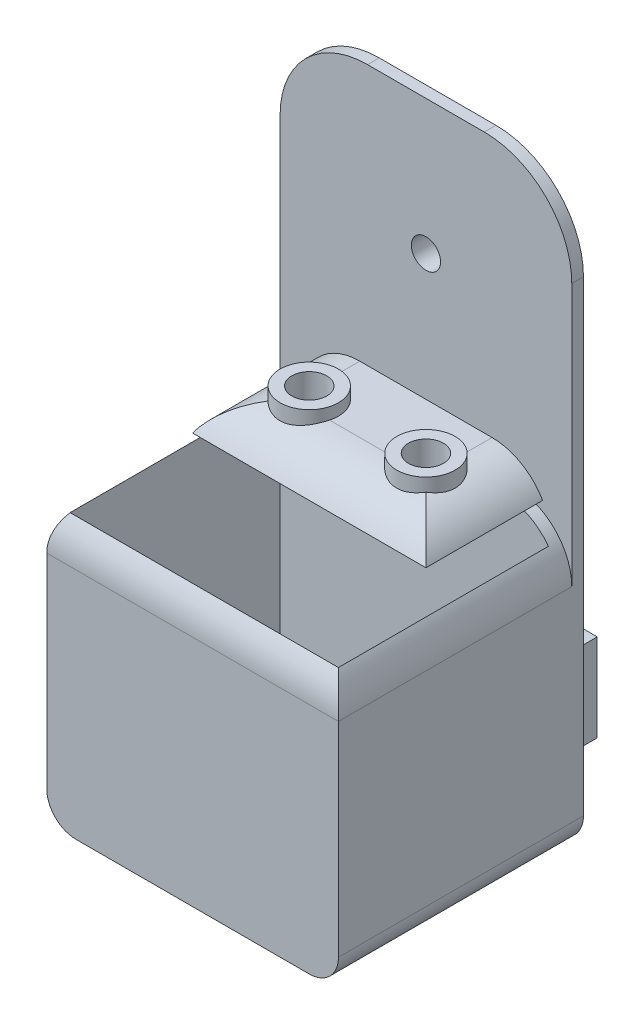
ISO-10303-21;
HEADER;
FILE_DESCRIPTION(('STEP AP214'),'2;1');
FILE_NAME('part.step','',(''),(''),'','','');
FILE_SCHEMA(('AUTOMOTIVE_DESIGN { 1 0 10303 214 1 1 1 1 }'));
ENDSEC;
DATA;
#1=APPLICATION_CONTEXT('core data for automotive mechanical design processes');
#2=APPLICATION_PROTOCOL_DEFINITION('international standard','automotive_design',2000,#1);
#3=PRODUCT_CONTEXT('',#1,'mechanical');
#4=PRODUCT('Part','Part','',(#3));
#5=PRODUCT_RELATED_PRODUCT_CATEGORY('part','',(#4));
#6=PRODUCT_DEFINITION_FORMATION('','',#4);
#7=PRODUCT_DEFINITION_CONTEXT('part definition',#1,'design');
#8=PRODUCT_DEFINITION('design','',#6,#7);
#9=PRODUCT_DEFINITION_SHAPE('','',#8);
#10=(LENGTH_UNIT() NAMED_UNIT(*) SI_UNIT(.MILLI.,.METRE.));
#11=(NAMED_UNIT(*) PLANE_ANGLE_UNIT() SI_UNIT($,.RADIAN.));
#12=(NAMED_UNIT(*) SI_UNIT($,.STERADIAN.) SOLID_ANGLE_UNIT());
#13=UNCERTAINTY_MEASURE_WITH_UNIT(LENGTH_MEASURE(1.E-05),#10,'distance_accuracy_value','');
#14=(GEOMETRIC_REPRESENTATION_CONTEXT(3) GLOBAL_UNCERTAINTY_ASSIGNED_CONTEXT((#13)) GLOBAL_UNIT_ASSIGNED_CONTEXT((#10,
#11,#12)) REPRESENTATION_CONTEXT('',''));
#15=CARTESIAN_POINT('',(0.,0.,0.));
#16=DIRECTION('',(0.,0.,1.));
#17=DIRECTION('',(1.,0.,0.));
#18=AXIS2_PLACEMENT_3D('',#15,#16,#17);
#19=CARTESIAN_POINT('',(-18.4566857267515,-25.2629086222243,-8.));
#20=DIRECTION('',(1.,0.,0.));
#21=DIRECTION('',(0.,1.,0.));
#22=AXIS2_PLACEMENT_3D('',#19,#20,#21);
#23=PLANE('',#22);
#24=DIRECTION('',(0.,1.,0.));
#25=VECTOR('',#24,1.);
#26=CARTESIAN_POINT('',(-18.4566857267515,-25.2629086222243,0.));
#27=LINE('',#26,#25);
#28=CARTESIAN_POINT('',(-18.4566857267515,-40.2629086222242,0.));
#29=VERTEX_POINT('',#28);
#30=CARTESIAN_POINT('',(-18.4566857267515,-25.2629086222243,0.));
#31=VERTEX_POINT('',#30);
#32=EDGE_CURVE('E109',#29,#31,#27,.T.);
#33=ORIENTED_EDGE('',*,*,#32,.T.);
#34=DIRECTION('',(0.,0.,1.));
#35=VECTOR('',#34,1.);
#36=CARTESIAN_POINT('',(-18.4566857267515,-25.2629086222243,-8.));
#37=LINE('',#36,#35);
#38=CARTESIAN_POINT('',(-18.4566857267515,-25.2629086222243,-8.));
#39=VERTEX_POINT('',#38);
#40=EDGE_CURVE('E12',#39,#31,#37,.T.);
#41=ORIENTED_EDGE('',*,*,#40,.F.);
#42=DIRECTION('',(0.,1.,0.));
#43=VECTOR('',#42,1.);
#44=CARTESIAN_POINT('',(-18.4566857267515,-25.2629086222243,-8.));
#45=LINE('',#44,#43);
#46=CARTESIAN_POINT('',(-18.4566857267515,-40.2629086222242,-8.));
#47=VERTEX_POINT('',#46);
#48=EDGE_CURVE('E97',#47,#39,#45,.T.);
#49=ORIENTED_EDGE('',*,*,#48,.F.);
#50=DIRECTION('',(0.,0.,1.));
#51=VECTOR('',#50,1.);
#52=CARTESIAN_POINT('',(-18.4566857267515,-40.2629086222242,-8.));
#53=LINE('',#52,#51);
#54=EDGE_CURVE('E105',#47,#29,#53,.T.);
#55=ORIENTED_EDGE('',*,*,#54,.T.);
#56=EDGE_LOOP('',(#33,#41,#49,#55));
#57=FACE_BOUND('',#56,.T.);
#58=ADVANCED_FACE('F46',(#57),#23,.F.);
#59=CARTESIAN_POINT('',(-8.45668572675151,-25.2629086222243,-8.));
#60=DIRECTION('',(0.,-1.,0.));
#61=DIRECTION('',(0.,0.,-1.));
#62=AXIS2_PLACEMENT_3D('',#59,#60,#61);
#63=PLANE('',#62);
#64=DIRECTION('',(1.,0.,0.));
#65=VECTOR('',#64,1.);
#66=CARTESIAN_POINT('',(-8.45668572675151,-25.2629086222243,0.));
#67=LINE('',#66,#65);
#68=CARTESIAN_POINT('',(-8.45668572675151,-25.2629086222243,0.));
#69=VERTEX_POINT('',#68);
#70=EDGE_CURVE('E101',#31,#69,#67,.T.);
#71=ORIENTED_EDGE('',*,*,#70,.T.);
#72=DIRECTION('',(0.,0.,1.));
#73=VECTOR('',#72,1.);
#74=CARTESIAN_POINT('',(-8.45668572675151,-25.2629086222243,-8.));
#75=LINE('',#74,#73);
#76=CARTESIAN_POINT('',(-8.45668572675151,-25.2629086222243,-8.));
#77=VERTEX_POINT('',#76);
#78=EDGE_CURVE('E54',#77,#69,#75,.T.);
#79=ORIENTED_EDGE('',*,*,#78,.F.);
#80=DIRECTION('',(1.,0.,0.));
#81=VECTOR('',#80,1.);
#82=CARTESIAN_POINT('',(-8.45668572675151,-25.2629086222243,-8.));
#83=LINE('',#82,#81);
#84=EDGE_CURVE('E92',#39,#77,#83,.T.);
#85=ORIENTED_EDGE('',*,*,#84,.F.);
#86=ORIENTED_EDGE('',*,*,#40,.T.);
#87=EDGE_LOOP('',(#71,#79,#85,#86));
#88=FACE_BOUND('',#87,.T.);
#89=ADVANCED_FACE('F100',(#88),#63,.F.);
#90=CARTESIAN_POINT('',(-8.45668572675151,-25.2629086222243,-8.));
#91=DIRECTION('',(-1.,0.,0.));
#92=DIRECTION('',(0.,-1.,0.));
#93=AXIS2_PLACEMENT_3D('',#90,#91,#92);
#94=PLANE('',#93);
#95=DIRECTION('',(0.,-1.,0.));
#96=VECTOR('',#95,1.);
#97=CARTESIAN_POINT('',(-8.45668572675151,-25.2629086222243,0.));
#98=LINE('',#97,#96);
#99=CARTESIAN_POINT('',(-8.45668572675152,-40.2629086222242,0.));
#100=VERTEX_POINT('',#99);
#101=EDGE_CURVE('E79',#69,#100,#98,.T.);
#102=ORIENTED_EDGE('',*,*,#101,.T.);
#103=DIRECTION('',(0.,0.,1.));
#104=VECTOR('',#103,1.);
#105=CARTESIAN_POINT('',(-8.45668572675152,-40.2629086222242,-8.));
#106=LINE('',#105,#104);
#107=CARTESIAN_POINT('',(-8.45668572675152,-40.2629086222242,-8.));
#108=VERTEX_POINT('',#107);
#109=EDGE_CURVE('E102',#108,#100,#106,.T.);
#110=ORIENTED_EDGE('',*,*,#109,.F.);
#111=DIRECTION('',(0.,-1.,0.));
#112=VECTOR('',#111,1.);
#113=CARTESIAN_POINT('',(-8.45668572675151,-25.2629086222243,-8.));
#114=LINE('',#113,#112);
#115=EDGE_CURVE('E95',#77,#108,#114,.T.);
#116=ORIENTED_EDGE('',*,*,#115,.F.);
#117=ORIENTED_EDGE('',*,*,#78,.T.);
#118=EDGE_LOOP('',(#102,#110,#116,#117));
#119=FACE_BOUND('',#118,.T.);
#120=ADVANCED_FACE('F103',(#119),#94,.F.);
#121=CARTESIAN_POINT('',(-8.45668572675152,-40.2629086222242,-8.));
#122=DIRECTION('',(0.,1.,0.));
#123=DIRECTION('',(0.,0.,1.));
#124=AXIS2_PLACEMENT_3D('',#121,#122,#123);
#125=PLANE('',#124);
#126=DIRECTION('',(-1.,0.,0.));
#127=VECTOR('',#126,1.);
#128=CARTESIAN_POINT('',(-8.45668572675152,-40.2629086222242,0.));
#129=LINE('',#128,#127);
#130=EDGE_CURVE('E85',#100,#29,#129,.T.);
#131=ORIENTED_EDGE('',*,*,#130,.T.);
#132=ORIENTED_EDGE('',*,*,#54,.F.);
#133=DIRECTION('',(-1.,0.,0.));
#134=VECTOR('',#133,1.);
#135=CARTESIAN_POINT('',(-8.45668572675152,-40.2629086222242,-8.));
#136=LINE('',#135,#134);
#137=EDGE_CURVE('E62',#108,#47,#136,.T.);
#138=ORIENTED_EDGE('',*,*,#137,.F.);
#139=ORIENTED_EDGE('',*,*,#109,.T.);
#140=EDGE_LOOP('',(#131,#132,#138,#139));
#141=FACE_BOUND('',#140,.T.);
#142=ADVANCED_FACE('F116',(#141),#125,.F.);
#143=CARTESIAN_POINT('',(0.,0.,-8.));
#144=DIRECTION('',(0.,0.,-1.));
#145=DIRECTION('',(-1.,0.,0.));
#146=AXIS2_PLACEMENT_3D('',#143,#144,#145);
#147=PLANE('',#146);
#148=ORIENTED_EDGE('',*,*,#48,.T.);
#149=ORIENTED_EDGE('',*,*,#84,.T.);
#150=ORIENTED_EDGE('',*,*,#115,.T.);
#151=ORIENTED_EDGE('',*,*,#137,.T.);
#152=EDGE_LOOP('',(#148,#149,#150,#151));
#153=FACE_BOUND('',#152,.T.);
#154=ADVANCED_FACE('F93',(#153),#147,.T.);
#155=CARTESIAN_POINT('',(0.,0.,0.));
#156=DIRECTION('',(0.,0.,-1.));
#157=DIRECTION('',(-1.,0.,0.));
#158=AXIS2_PLACEMENT_3D('',#155,#156,#157);
#159=PLANE('',#158);
#160=ORIENTED_EDGE('',*,*,#32,.F.);
#161=ORIENTED_EDGE('',*,*,#130,.F.);
#162=ORIENTED_EDGE('',*,*,#101,.F.);
#163=ORIENTED_EDGE('',*,*,#70,.F.);
#164=EDGE_LOOP('',(#160,#161,#162,#163));
#165=FACE_BOUND('',#164,.T.);
#166=ADVANCED_FACE('F119',(#165),#159,.F.);
#167=CLOSED_SHELL('',(#58,#89,#120,#142,#154,#166));
#168=MANIFOLD_SOLID_BREP('B2',#167);
#169=CARTESIAN_POINT('',(9.3645464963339,-25.2629086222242,-8.));
#170=DIRECTION('',(1.,0.,0.));
#171=DIRECTION('',(0.,1.,0.));
#172=AXIS2_PLACEMENT_3D('',#169,#170,#171);
#173=PLANE('',#172);
#174=DIRECTION('',(0.,1.,0.));
#175=VECTOR('',#174,1.);
#176=CARTESIAN_POINT('',(9.3645464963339,-25.2629086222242,0.));
#177=LINE('',#176,#175);
#178=CARTESIAN_POINT('',(9.3645464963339,-40.2629086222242,0.));
#179=VERTEX_POINT('',#178);
#180=CARTESIAN_POINT('',(9.3645464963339,-25.2629086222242,0.));
#181=VERTEX_POINT('',#180);
#182=EDGE_CURVE('E242',#179,#181,#177,.T.);
#183=ORIENTED_EDGE('',*,*,#182,.T.);
#184=DIRECTION('',(0.,0.,1.));
#185=VECTOR('',#184,1.);
#186=CARTESIAN_POINT('',(9.3645464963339,-25.2629086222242,-8.));
#187=LINE('',#186,#185);
#188=CARTESIAN_POINT('',(9.3645464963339,-25.2629086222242,-8.));
#189=VERTEX_POINT('',#188);
#190=EDGE_CURVE('E44',#189,#181,#187,.T.);
#191=ORIENTED_EDGE('',*,*,#190,.F.);
#192=DIRECTION('',(0.,1.,0.));
#193=VECTOR('',#192,1.);
#194=CARTESIAN_POINT('',(9.3645464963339,-25.2629086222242,-8.));
#195=LINE('',#194,#193);
#196=CARTESIAN_POINT('',(9.3645464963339,-40.2629086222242,-8.));
#197=VERTEX_POINT('',#196);
#198=EDGE_CURVE('E230',#197,#189,#195,.T.);
#199=ORIENTED_EDGE('',*,*,#198,.F.);
#200=DIRECTION('',(0.,0.,1.));
#201=VECTOR('',#200,1.);
#202=CARTESIAN_POINT('',(9.3645464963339,-40.2629086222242,-8.));
#203=LINE('',#202,#201);
#204=EDGE_CURVE('E238',#197,#179,#203,.T.);
#205=ORIENTED_EDGE('',*,*,#204,.T.);
#206=EDGE_LOOP('',(#183,#191,#199,#205));
#207=FACE_BOUND('',#206,.T.);
#208=ADVANCED_FACE('F179',(#207),#173,.F.);
#209=CARTESIAN_POINT('',(19.3645464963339,-25.2629086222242,-8.));
#210=DIRECTION('',(0.,-1.,0.));
#211=DIRECTION('',(0.,0.,-1.));
#212=AXIS2_PLACEMENT_3D('',#209,#210,#211);
#213=PLANE('',#212);
#214=DIRECTION('',(1.,0.,0.));
#215=VECTOR('',#214,1.);
#216=CARTESIAN_POINT('',(19.3645464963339,-25.2629086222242,0.));
#217=LINE('',#216,#215);
#218=CARTESIAN_POINT('',(19.3645464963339,-25.2629086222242,0.));
#219=VERTEX_POINT('',#218);
#220=EDGE_CURVE('E234',#181,#219,#217,.T.);
#221=ORIENTED_EDGE('',*,*,#220,.T.);
#222=DIRECTION('',(0.,0.,1.));
#223=VECTOR('',#222,1.);
#224=CARTESIAN_POINT('',(19.3645464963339,-25.2629086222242,-8.));
#225=LINE('',#224,#223);
#226=CARTESIAN_POINT('',(19.3645464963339,-25.2629086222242,-8.));
#227=VERTEX_POINT('',#226);
#228=EDGE_CURVE('E187',#227,#219,#225,.T.);
#229=ORIENTED_EDGE('',*,*,#228,.F.);
#230=DIRECTION('',(1.,0.,0.));
#231=VECTOR('',#230,1.);
#232=CARTESIAN_POINT('',(19.3645464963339,-25.2629086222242,-8.));
#233=LINE('',#232,#231);
#234=EDGE_CURVE('E225',#189,#227,#233,.T.);
#235=ORIENTED_EDGE('',*,*,#234,.F.);
#236=ORIENTED_EDGE('',*,*,#190,.T.);
#237=EDGE_LOOP('',(#221,#229,#235,#236));
#238=FACE_BOUND('',#237,.T.);
#239=ADVANCED_FACE('F233',(#238),#213,.F.);
#240=CARTESIAN_POINT('',(19.3645464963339,-25.2629086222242,-8.));
#241=DIRECTION('',(-1.,0.,0.));
#242=DIRECTION('',(0.,-1.,0.));
#243=AXIS2_PLACEMENT_3D('',#240,#241,#242);
#244=PLANE('',#243);
#245=DIRECTION('',(0.,-1.,0.));
#246=VECTOR('',#245,1.);
#247=CARTESIAN_POINT('',(19.3645464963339,-25.2629086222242,0.));
#248=LINE('',#247,#246);
#249=CARTESIAN_POINT('',(19.3645464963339,-40.2629086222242,0.));
#250=VERTEX_POINT('',#249);
#251=EDGE_CURVE('E212',#219,#250,#248,.T.);
#252=ORIENTED_EDGE('',*,*,#251,.T.);
#253=DIRECTION('',(0.,0.,1.));
#254=VECTOR('',#253,1.);
#255=CARTESIAN_POINT('',(19.3645464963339,-40.2629086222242,-8.));
#256=LINE('',#255,#254);
#257=CARTESIAN_POINT('',(19.3645464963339,-40.2629086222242,-8.));
#258=VERTEX_POINT('',#257);
#259=EDGE_CURVE('E235',#258,#250,#256,.T.);
#260=ORIENTED_EDGE('',*,*,#259,.F.);
#261=DIRECTION('',(0.,-1.,0.));
#262=VECTOR('',#261,1.);
#263=CARTESIAN_POINT('',(19.3645464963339,-25.2629086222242,-8.));
#264=LINE('',#263,#262);
#265=EDGE_CURVE('E228',#227,#258,#264,.T.);
#266=ORIENTED_EDGE('',*,*,#265,.F.);
#267=ORIENTED_EDGE('',*,*,#228,.T.);
#268=EDGE_LOOP('',(#252,#260,#266,#267));
#269=FACE_BOUND('',#268,.T.);
#270=ADVANCED_FACE('F236',(#269),#244,.F.);
#271=CARTESIAN_POINT('',(19.3645464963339,-40.2629086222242,-8.));
#272=DIRECTION('',(0.,1.,0.));
#273=DIRECTION('',(0.,0.,1.));
#274=AXIS2_PLACEMENT_3D('',#271,#272,#273);
#275=PLANE('',#274);
#276=DIRECTION('',(-1.,0.,0.));
#277=VECTOR('',#276,1.);
#278=CARTESIAN_POINT('',(19.3645464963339,-40.2629086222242,0.));
#279=LINE('',#278,#277);
#280=EDGE_CURVE('E218',#250,#179,#279,.T.);
#281=ORIENTED_EDGE('',*,*,#280,.T.);
#282=ORIENTED_EDGE('',*,*,#204,.F.);
#283=DIRECTION('',(-1.,0.,0.));
#284=VECTOR('',#283,1.);
#285=CARTESIAN_POINT('',(19.3645464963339,-40.2629086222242,-8.));
#286=LINE('',#285,#284);
#287=EDGE_CURVE('E195',#258,#197,#286,.T.);
#288=ORIENTED_EDGE('',*,*,#287,.F.);
#289=ORIENTED_EDGE('',*,*,#259,.T.);
#290=EDGE_LOOP('',(#281,#282,#288,#289));
#291=FACE_BOUND('',#290,.T.);
#292=ADVANCED_FACE('F249',(#291),#275,.F.);
#293=CARTESIAN_POINT('',(0.,0.,-8.));
#294=DIRECTION('',(0.,0.,-1.));
#295=DIRECTION('',(-1.,0.,0.));
#296=AXIS2_PLACEMENT_3D('',#293,#294,#295);
#297=PLANE('',#296);
#298=ORIENTED_EDGE('',*,*,#198,.T.);
#299=ORIENTED_EDGE('',*,*,#234,.T.);
#300=ORIENTED_EDGE('',*,*,#265,.T.);
#301=ORIENTED_EDGE('',*,*,#287,.T.);
#302=EDGE_LOOP('',(#298,#299,#300,#301));
#303=FACE_BOUND('',#302,.T.);
#304=ADVANCED_FACE('F226',(#303),#297,.T.);
#305=CARTESIAN_POINT('',(0.,0.,0.));
#306=DIRECTION('',(0.,0.,-1.));
#307=DIRECTION('',(-1.,0.,0.));
#308=AXIS2_PLACEMENT_3D('',#305,#306,#307);
#309=PLANE('',#308);
#310=ORIENTED_EDGE('',*,*,#182,.F.);
#311=ORIENTED_EDGE('',*,*,#280,.F.);
#312=ORIENTED_EDGE('',*,*,#251,.F.);
#313=ORIENTED_EDGE('',*,*,#220,.F.);
#314=EDGE_LOOP('',(#310,#311,#312,#313));
#315=FACE_BOUND('',#314,.T.);
#316=ADVANCED_FACE('F252',(#315),#309,.F.);
#317=CLOSED_SHELL('',(#208,#239,#270,#292,#304,#316));
#318=MANIFOLD_SOLID_BREP('B6',#317);
#319=CARTESIAN_POINT('',(20.,-45.,0.));
#320=DIRECTION('',(0.,0.,-1.));
#321=DIRECTION('',(-1.,0.,0.));
#322=AXIS2_PLACEMENT_3D('',#319,#320,#321);
#323=PLANE('',#322);
#324=CARTESIAN_POINT('',(20.,-45.,0.));
#325=DIRECTION('',(0.,0.,1.));
#326=DIRECTION('',(-1.,0.,0.));
#327=AXIS2_PLACEMENT_3D('',#324,#325,#326);
#328=CIRCLE('',#327,5.);
#329=CARTESIAN_POINT('',(20.,-50.,0.));
#330=VERTEX_POINT('',#329);
#331=CARTESIAN_POINT('',(25.,-44.9999999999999,0.));
#332=VERTEX_POINT('',#331);
#333=EDGE_CURVE('E585',#330,#332,#328,.T.);
#334=ORIENTED_EDGE('',*,*,#333,.F.);
#335=DIRECTION('',(1.,0.,0.));
#336=VECTOR('',#335,1.);
#337=CARTESIAN_POINT('',(-20.,-50.,0.));
#338=LINE('',#337,#336);
#339=CARTESIAN_POINT('',(-20.,-50.,0.));
#340=VERTEX_POINT('',#339);
#341=EDGE_CURVE('E591',#340,#330,#338,.T.);
#342=ORIENTED_EDGE('',*,*,#341,.F.);
#343=CARTESIAN_POINT('',(-20.,-45.,0.));
#344=DIRECTION('',(0.,0.,1.));
#345=DIRECTION('',(-1.,0.,0.));
#346=AXIS2_PLACEMENT_3D('',#343,#344,#345);
#347=CIRCLE('',#346,5.);
#348=CARTESIAN_POINT('',(-25.,-44.9999999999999,0.));
#349=VERTEX_POINT('',#348);
#350=EDGE_CURVE('E612',#349,#340,#347,.T.);
#351=ORIENTED_EDGE('',*,*,#350,.F.);
#352=DIRECTION('',(0.,-1.,0.));
#353=VECTOR('',#352,1.);
#354=CARTESIAN_POINT('',(-25.,34.9999999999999,0.));
#355=LINE('',#354,#353);
#356=CARTESIAN_POINT('',(-25.,34.9999999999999,0.));
#357=VERTEX_POINT('',#356);
#358=EDGE_CURVE('E610',#357,#349,#355,.T.);
#359=ORIENTED_EDGE('',*,*,#358,.F.);
#360=CARTESIAN_POINT('',(-10.,35.,0.));
#361=DIRECTION('',(0.,0.,1.));
#362=DIRECTION('',(-1.,0.,0.));
#363=AXIS2_PLACEMENT_3D('',#360,#361,#362);
#364=CIRCLE('',#363,15.);
#365=CARTESIAN_POINT('',(-9.9999999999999,50.,0.));
#366=VERTEX_POINT('',#365);
#367=EDGE_CURVE('E608',#366,#357,#364,.T.);
#368=ORIENTED_EDGE('',*,*,#367,.F.);
#369=DIRECTION('',(-1.,0.,0.));
#370=VECTOR('',#369,1.);
#371=CARTESIAN_POINT('',(-9.9999999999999,50.,0.));
#372=LINE('',#371,#370);
#373=CARTESIAN_POINT('',(9.99999999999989,50.,0.));
#374=VERTEX_POINT('',#373);
#375=EDGE_CURVE('E606',#374,#366,#372,.T.);
#376=ORIENTED_EDGE('',*,*,#375,.F.);
#377=CARTESIAN_POINT('',(9.99999999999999,35.,0.));
#378=DIRECTION('',(0.,0.,1.));
#379=DIRECTION('',(1.,0.,0.));
#380=AXIS2_PLACEMENT_3D('',#377,#378,#379);
#381=CIRCLE('',#380,15.);
#382=CARTESIAN_POINT('',(25.,34.9999999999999,0.));
#383=VERTEX_POINT('',#382);
#384=EDGE_CURVE('E604',#383,#374,#381,.T.);
#385=ORIENTED_EDGE('',*,*,#384,.F.);
#386=DIRECTION('',(0.,1.,0.));
#387=VECTOR('',#386,1.);
#388=CARTESIAN_POINT('',(25.,34.9999999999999,0.));
#389=LINE('',#388,#387);
#390=EDGE_CURVE('E602',#332,#383,#389,.T.);
#391=ORIENTED_EDGE('',*,*,#390,.F.);
#392=EDGE_LOOP('',(#334,#342,#351,#359,#368,#376,#385,#391));
#393=FACE_BOUND('',#392,.T.);
#394=DIRECTION('',(1.,0.,0.));
#395=VECTOR('',#394,1.);
#396=CARTESIAN_POINT('',(5.00000000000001,34.055276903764,0.));
#397=LINE('',#396,#395);
#398=CARTESIAN_POINT('',(-4.99999999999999,34.055276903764,0.));
#399=VERTEX_POINT('',#398);
#400=CARTESIAN_POINT('',(5.00000000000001,34.055276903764,0.));
#401=VERTEX_POINT('',#400);
#402=EDGE_CURVE('E1072',#399,#401,#397,.T.);
#403=ORIENTED_EDGE('',*,*,#402,.F.);
#404=DIRECTION('',(0.,1.,0.));
#405=VECTOR('',#404,1.);
#406=CARTESIAN_POINT('',(-4.99999999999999,34.055276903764,0.));
#407=LINE('',#406,#405);
#408=CARTESIAN_POINT('',(-4.99999999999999,19.055276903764,0.));
#409=VERTEX_POINT('',#408);
#410=EDGE_CURVE('E502',#409,#399,#407,.T.);
#411=ORIENTED_EDGE('',*,*,#410,.F.);
#412=DIRECTION('',(-1.,0.,0.));
#413=VECTOR('',#412,1.);
#414=CARTESIAN_POINT('',(5.00000000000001,19.055276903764,0.));
#415=LINE('',#414,#413);
#416=CARTESIAN_POINT('',(5.00000000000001,19.055276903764,0.));
#417=VERTEX_POINT('',#416);
#418=EDGE_CURVE('E498',#417,#409,#415,.T.);
#419=ORIENTED_EDGE('',*,*,#418,.F.);
#420=DIRECTION('',(0.,-1.,0.));
#421=VECTOR('',#420,1.);
#422=CARTESIAN_POINT('',(5.00000000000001,34.055276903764,0.));
#423=LINE('',#422,#421);
#424=EDGE_CURVE('E1074',#401,#417,#423,.T.);
#425=ORIENTED_EDGE('',*,*,#424,.F.);
#426=EDGE_LOOP('',(#403,#411,#419,#425));
#427=FACE_BOUND('',#426,.T.);
#428=ADVANCED_FACE('F303',(#393,#427),#323,.T.);
#429=CARTESIAN_POINT('',(20.,-45.,2.));
#430=DIRECTION('',(0.,0.,-1.));
#431=DIRECTION('',(-1.,0.,0.));
#432=AXIS2_PLACEMENT_3D('',#429,#430,#431);
#433=PLANE('',#432);
#434=CARTESIAN_POINT('',(0.,26.9677027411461,2.));
#435=DIRECTION('',(0.,0.,-1.));
#436=DIRECTION('',(-1.,0.,0.));
#437=AXIS2_PLACEMENT_3D('',#434,#435,#436);
#438=CIRCLE('',#437,2.5);
#439=CARTESIAN_POINT('',(-2.5,26.9677027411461,2.));
#440=VERTEX_POINT('',#439);
#441=EDGE_CURVE('E1061',#440,#440,#438,.T.);
#442=ORIENTED_EDGE('',*,*,#441,.T.);
#443=EDGE_LOOP('',(#442));
#444=FACE_BOUND('',#443,.T.);
#445=DIRECTION('',(0.,-1.,0.));
#446=VECTOR('',#445,1.);
#447=CARTESIAN_POINT('',(-25.,34.9999999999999,2.));
#448=LINE('',#447,#446);
#449=CARTESIAN_POINT('',(-25.,34.9999999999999,2.));
#450=VERTEX_POINT('',#449);
#451=CARTESIAN_POINT('',(-25.,-10.,2.));
#452=VERTEX_POINT('',#451);
#453=EDGE_CURVE('E597',#450,#452,#448,.T.);
#454=ORIENTED_EDGE('',*,*,#453,.T.);
#455=CARTESIAN_POINT('',(-15.,-10.,2.));
#456=DIRECTION('',(0.,0.,-1.));
#457=DIRECTION('',(-1.,0.,0.));
#458=AXIS2_PLACEMENT_3D('',#455,#456,#457);
#459=CIRCLE('',#458,10.);
#460=CARTESIAN_POINT('',(-15.,0.,2.));
#461=VERTEX_POINT('',#460);
#462=EDGE_CURVE('E663',#452,#461,#459,.T.);
#463=ORIENTED_EDGE('',*,*,#462,.T.);
#464=DIRECTION('',(1.,0.,0.));
#465=VECTOR('',#464,1.);
#466=CARTESIAN_POINT('',(0.,0.,2.));
#467=LINE('',#466,#465);
#468=CARTESIAN_POINT('',(15.,0.,2.));
#469=VERTEX_POINT('',#468);
#470=EDGE_CURVE('E562',#461,#469,#467,.T.);
#471=ORIENTED_EDGE('',*,*,#470,.T.);
#472=CARTESIAN_POINT('',(15.,-10.,2.));
#473=DIRECTION('',(0.,0.,-1.));
#474=DIRECTION('',(-1.,0.,0.));
#475=AXIS2_PLACEMENT_3D('',#472,#473,#474);
#476=CIRCLE('',#475,10.);
#477=CARTESIAN_POINT('',(25.,-10.,2.));
#478=VERTEX_POINT('',#477);
#479=EDGE_CURVE('E660',#469,#478,#476,.T.);
#480=ORIENTED_EDGE('',*,*,#479,.T.);
#481=DIRECTION('',(0.,1.,0.));
#482=VECTOR('',#481,1.);
#483=CARTESIAN_POINT('',(25.,34.9999999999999,2.));
#484=LINE('',#483,#482);
#485=CARTESIAN_POINT('',(25.,34.9999999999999,2.));
#486=VERTEX_POINT('',#485);
#487=EDGE_CURVE('E588',#478,#486,#484,.T.);
#488=ORIENTED_EDGE('',*,*,#487,.T.);
#489=CARTESIAN_POINT('',(9.99999999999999,35.,2.));
#490=DIRECTION('',(0.,0.,1.));
#491=DIRECTION('',(1.,0.,0.));
#492=AXIS2_PLACEMENT_3D('',#489,#490,#491);
#493=CIRCLE('',#492,15.);
#494=CARTESIAN_POINT('',(9.99999999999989,50.,2.));
#495=VERTEX_POINT('',#494);
#496=EDGE_CURVE('E590',#486,#495,#493,.T.);
#497=ORIENTED_EDGE('',*,*,#496,.T.);
#498=DIRECTION('',(-1.,0.,0.));
#499=VECTOR('',#498,1.);
#500=CARTESIAN_POINT('',(-9.9999999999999,50.,2.));
#501=LINE('',#500,#499);
#502=CARTESIAN_POINT('',(-9.9999999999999,50.,2.));
#503=VERTEX_POINT('',#502);
#504=EDGE_CURVE('E593',#495,#503,#501,.T.);
#505=ORIENTED_EDGE('',*,*,#504,.T.);
#506=CARTESIAN_POINT('',(-10.,35.,2.));
#507=DIRECTION('',(0.,0.,1.));
#508=DIRECTION('',(-1.,0.,0.));
#509=AXIS2_PLACEMENT_3D('',#506,#507,#508);
#510=CIRCLE('',#509,15.);
#511=EDGE_CURVE('E595',#503,#450,#510,.T.);
#512=ORIENTED_EDGE('',*,*,#511,.T.);
#513=EDGE_LOOP('',(#454,#463,#471,#480,#488,#497,#505,#512));
#514=FACE_BOUND('',#513,.T.);
#515=DIRECTION('',(-1.,0.,0.));
#516=VECTOR('',#515,1.);
#517=CARTESIAN_POINT('',(-20.,5.3108308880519,2.));
#518=LINE('',#517,#516);
#519=CARTESIAN_POINT('',(11.3397459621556,5.3108308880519,2.));
#520=VERTEX_POINT('',#519);
#521=CARTESIAN_POINT('',(-11.3397459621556,5.3108308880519,2.));
#522=VERTEX_POINT('',#521);
#523=EDGE_CURVE('E528',#520,#522,#518,.T.);
#524=ORIENTED_EDGE('',*,*,#523,.F.);
#525=CARTESIAN_POINT('',(11.3397459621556,-4.6891691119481,2.));
#526=DIRECTION('',(0.,0.,-1.));
#527=DIRECTION('',(-1.,0.,0.));
#528=AXIS2_PLACEMENT_3D('',#525,#526,#527);
#529=CIRCLE('',#528,10.);
#530=CARTESIAN_POINT('',(20.,0.310830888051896,2.));
#531=VERTEX_POINT('',#530);
#532=EDGE_CURVE('E313',#520,#531,#529,.T.);
#533=ORIENTED_EDGE('',*,*,#532,.T.);
#534=DIRECTION('',(1.,0.,0.));
#535=VECTOR('',#534,1.);
#536=CARTESIAN_POINT('',(-20.,0.310830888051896,2.));
#537=LINE('',#536,#535);
#538=CARTESIAN_POINT('',(-20.,0.310830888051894,2.));
#539=VERTEX_POINT('',#538);
#540=EDGE_CURVE('E533',#539,#531,#537,.T.);
#541=ORIENTED_EDGE('',*,*,#540,.F.);
#542=CARTESIAN_POINT('',(-11.3397459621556,-4.6891691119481,2.));
#543=DIRECTION('',(0.,0.,-1.));
#544=DIRECTION('',(-1.,0.,0.));
#545=AXIS2_PLACEMENT_3D('',#542,#543,#544);
#546=CIRCLE('',#545,10.);
#547=EDGE_CURVE('E680',#539,#522,#546,.T.);
#548=ORIENTED_EDGE('',*,*,#547,.T.);
#549=EDGE_LOOP('',(#524,#533,#541,#548));
#550=FACE_BOUND('',#549,.T.);
#551=ADVANCED_FACE('F741',(#444,#514,#550),#433,.F.);
#552=CARTESIAN_POINT('',(20.,-45.,2.));
#553=DIRECTION('',(0.,0.,-1.));
#554=DIRECTION('',(-1.,0.,0.));
#555=AXIS2_PLACEMENT_3D('',#552,#553,#554);
#556=CYLINDRICAL_SURFACE('',#555,5.);
#557=ORIENTED_EDGE('',*,*,#333,.T.);
#558=DIRECTION('',(0.,0.,-1.));
#559=VECTOR('',#558,1.);
#560=CARTESIAN_POINT('',(25.,-44.9999999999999,2.));
#561=LINE('',#560,#559);
#562=CARTESIAN_POINT('',(25.,-44.9999999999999,42.));
#563=VERTEX_POINT('',#562);
#564=EDGE_CURVE('E635',#563,#332,#561,.T.);
#565=ORIENTED_EDGE('',*,*,#564,.F.);
#566=CARTESIAN_POINT('',(20.,-45.,42.));
#567=DIRECTION('',(0.,0.,1.));
#568=DIRECTION('',(1.,0.,0.));
#569=AXIS2_PLACEMENT_3D('',#566,#567,#568);
#570=CIRCLE('',#569,5.);
#571=CARTESIAN_POINT('',(20.,-50.,42.));
#572=VERTEX_POINT('',#571);
#573=EDGE_CURVE('E579',#572,#563,#570,.T.);
#574=ORIENTED_EDGE('',*,*,#573,.F.);
#575=DIRECTION('',(0.,0.,-1.));
#576=VECTOR('',#575,1.);
#577=CARTESIAN_POINT('',(20.,-50.,2.));
#578=LINE('',#577,#576);
#579=EDGE_CURVE('E599',#572,#330,#578,.T.);
#580=ORIENTED_EDGE('',*,*,#579,.T.);
#581=EDGE_LOOP('',(#557,#565,#574,#580));
#582=FACE_BOUND('',#581,.T.);
#583=ADVANCED_FACE('F747',(#582),#556,.T.);
#584=CARTESIAN_POINT('',(25.,34.9999999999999,2.));
#585=DIRECTION('',(-1.,0.,0.));
#586=DIRECTION('',(0.,-1.,0.));
#587=AXIS2_PLACEMENT_3D('',#584,#585,#586);
#588=PLANE('',#587);
#589=ORIENTED_EDGE('',*,*,#487,.F.);
#590=DIRECTION('',(0.,0.,-1.));
#591=VECTOR('',#590,1.);
#592=CARTESIAN_POINT('',(25.,-10.,42.));
#593=LINE('',#592,#591);
#594=CARTESIAN_POINT('',(25.,-10.,42.));
#595=VERTEX_POINT('',#594);
#596=EDGE_CURVE('E643',#478,#595,#593,.F.);
#597=ORIENTED_EDGE('',*,*,#596,.T.);
#598=DIRECTION('',(0.,1.,0.));
#599=VECTOR('',#598,1.);
#600=CARTESIAN_POINT('',(25.,0.,42.));
#601=LINE('',#600,#599);
#602=EDGE_CURVE('E582',#563,#595,#601,.T.);
#603=ORIENTED_EDGE('',*,*,#602,.F.);
#604=ORIENTED_EDGE('',*,*,#564,.T.);
#605=ORIENTED_EDGE('',*,*,#390,.T.);
#606=DIRECTION('',(0.,0.,-1.));
#607=VECTOR('',#606,1.);
#608=CARTESIAN_POINT('',(25.,34.9999999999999,2.));
#609=LINE('',#608,#607);
#610=EDGE_CURVE('E632',#486,#383,#609,.T.);
#611=ORIENTED_EDGE('',*,*,#610,.F.);
#612=EDGE_LOOP('',(#589,#597,#603,#604,#605,#611));
#613=FACE_BOUND('',#612,.T.);
#614=ADVANCED_FACE('F778',(#613),#588,.F.);
#615=CARTESIAN_POINT('',(9.99999999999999,35.,2.));
#616=DIRECTION('',(0.,0.,-1.));
#617=DIRECTION('',(-1.,0.,0.));
#618=AXIS2_PLACEMENT_3D('',#615,#616,#617);
#619=CYLINDRICAL_SURFACE('',#618,15.);
#620=ORIENTED_EDGE('',*,*,#384,.T.);
#621=DIRECTION('',(0.,0.,-1.));
#622=VECTOR('',#621,1.);
#623=CARTESIAN_POINT('',(9.99999999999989,50.,2.));
#624=LINE('',#623,#622);
#625=EDGE_CURVE('E629',#495,#374,#624,.T.);
#626=ORIENTED_EDGE('',*,*,#625,.F.);
#627=ORIENTED_EDGE('',*,*,#496,.F.);
#628=ORIENTED_EDGE('',*,*,#610,.T.);
#629=EDGE_LOOP('',(#620,#626,#627,#628));
#630=FACE_BOUND('',#629,.T.);
#631=ADVANCED_FACE('F774',(#630),#619,.T.);
#632=CARTESIAN_POINT('',(-9.9999999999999,50.,2.));
#633=DIRECTION('',(0.,-1.,0.));
#634=DIRECTION('',(0.,0.,-1.));
#635=AXIS2_PLACEMENT_3D('',#632,#633,#634);
#636=PLANE('',#635);
#637=ORIENTED_EDGE('',*,*,#375,.T.);
#638=DIRECTION('',(0.,0.,-1.));
#639=VECTOR('',#638,1.);
#640=CARTESIAN_POINT('',(-9.9999999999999,50.,2.));
#641=LINE('',#640,#639);
#642=EDGE_CURVE('E626',#503,#366,#641,.T.);
#643=ORIENTED_EDGE('',*,*,#642,.F.);
#644=ORIENTED_EDGE('',*,*,#504,.F.);
#645=ORIENTED_EDGE('',*,*,#625,.T.);
#646=EDGE_LOOP('',(#637,#643,#644,#645));
#647=FACE_BOUND('',#646,.T.);
#648=ADVANCED_FACE('F770',(#647),#636,.F.);
#649=CARTESIAN_POINT('',(-10.,35.,2.));
#650=DIRECTION('',(0.,0.,-1.));
#651=DIRECTION('',(-1.,0.,0.));
#652=AXIS2_PLACEMENT_3D('',#649,#650,#651);
#653=CYLINDRICAL_SURFACE('',#652,15.);
#654=ORIENTED_EDGE('',*,*,#367,.T.);
#655=DIRECTION('',(0.,0.,-1.));
#656=VECTOR('',#655,1.);
#657=CARTESIAN_POINT('',(-25.,34.9999999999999,2.));
#658=LINE('',#657,#656);
#659=EDGE_CURVE('E623',#450,#357,#658,.T.);
#660=ORIENTED_EDGE('',*,*,#659,.F.);
#661=ORIENTED_EDGE('',*,*,#511,.F.);
#662=ORIENTED_EDGE('',*,*,#642,.T.);
#663=EDGE_LOOP('',(#654,#660,#661,#662));
#664=FACE_BOUND('',#663,.T.);
#665=ADVANCED_FACE('F766',(#664),#653,.T.);
#666=CARTESIAN_POINT('',(-25.,34.9999999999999,2.));
#667=DIRECTION('',(1.,0.,0.));
#668=DIRECTION('',(0.,1.,0.));
#669=AXIS2_PLACEMENT_3D('',#666,#667,#668);
#670=PLANE('',#669);
#671=DIRECTION('',(0.,-1.,0.));
#672=VECTOR('',#671,1.);
#673=CARTESIAN_POINT('',(-25.,0.,42.));
#674=LINE('',#673,#672);
#675=CARTESIAN_POINT('',(-25.,-10.,42.));
#676=VERTEX_POINT('',#675);
#677=CARTESIAN_POINT('',(-25.,-44.9999999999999,42.));
#678=VERTEX_POINT('',#677);
#679=EDGE_CURVE('E571',#676,#678,#674,.T.);
#680=ORIENTED_EDGE('',*,*,#679,.F.);
#681=DIRECTION('',(0.,0.,-1.));
#682=VECTOR('',#681,1.);
#683=CARTESIAN_POINT('',(-25.,-10.,2.));
#684=LINE('',#683,#682);
#685=EDGE_CURVE('E655',#676,#452,#684,.T.);
#686=ORIENTED_EDGE('',*,*,#685,.T.);
#687=ORIENTED_EDGE('',*,*,#453,.F.);
#688=ORIENTED_EDGE('',*,*,#659,.T.);
#689=ORIENTED_EDGE('',*,*,#358,.T.);
#690=DIRECTION('',(0.,0.,-1.));
#691=VECTOR('',#690,1.);
#692=CARTESIAN_POINT('',(-25.,-44.9999999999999,2.));
#693=LINE('',#692,#691);
#694=EDGE_CURVE('E620',#678,#349,#693,.T.);
#695=ORIENTED_EDGE('',*,*,#694,.F.);
#696=EDGE_LOOP('',(#680,#686,#687,#688,#689,#695));
#697=FACE_BOUND('',#696,.T.);
#698=ADVANCED_FACE('F762',(#697),#670,.F.);
#699=CARTESIAN_POINT('',(-20.,-45.,2.));
#700=DIRECTION('',(0.,0.,-1.));
#701=DIRECTION('',(-1.,0.,0.));
#702=AXIS2_PLACEMENT_3D('',#699,#700,#701);
#703=CYLINDRICAL_SURFACE('',#702,5.);
#704=ORIENTED_EDGE('',*,*,#350,.T.);
#705=DIRECTION('',(0.,0.,-1.));
#706=VECTOR('',#705,1.);
#707=CARTESIAN_POINT('',(-20.,-50.,2.));
#708=LINE('',#707,#706);
#709=CARTESIAN_POINT('',(-20.,-50.,42.));
#710=VERTEX_POINT('',#709);
#711=EDGE_CURVE('E617',#710,#340,#708,.T.);
#712=ORIENTED_EDGE('',*,*,#711,.F.);
#713=CARTESIAN_POINT('',(-20.,-45.,42.));
#714=DIRECTION('',(0.,0.,1.));
#715=DIRECTION('',(1.,0.,0.));
#716=AXIS2_PLACEMENT_3D('',#713,#714,#715);
#717=CIRCLE('',#716,5.);
#718=EDGE_CURVE('E573',#678,#710,#717,.T.);
#719=ORIENTED_EDGE('',*,*,#718,.F.);
#720=ORIENTED_EDGE('',*,*,#694,.T.);
#721=EDGE_LOOP('',(#704,#712,#719,#720));
#722=FACE_BOUND('',#721,.T.);
#723=ADVANCED_FACE('F758',(#722),#703,.T.);
#724=CARTESIAN_POINT('',(-20.,-50.,2.));
#725=DIRECTION('',(0.,1.,0.));
#726=DIRECTION('',(0.,0.,1.));
#727=AXIS2_PLACEMENT_3D('',#724,#725,#726);
#728=PLANE('',#727);
#729=ORIENTED_EDGE('',*,*,#341,.T.);
#730=ORIENTED_EDGE('',*,*,#579,.F.);
#731=DIRECTION('',(1.,0.,0.));
#732=VECTOR('',#731,1.);
#733=CARTESIAN_POINT('',(0.,-50.,42.));
#734=LINE('',#733,#732);
#735=EDGE_CURVE('E576',#710,#572,#734,.T.);
#736=ORIENTED_EDGE('',*,*,#735,.F.);
#737=ORIENTED_EDGE('',*,*,#711,.T.);
#738=EDGE_LOOP('',(#729,#730,#736,#737));
#739=FACE_BOUND('',#738,.T.);
#740=ADVANCED_FACE('F754',(#739),#728,.F.);
#741=CARTESIAN_POINT('',(0.,0.,42.));
#742=DIRECTION('',(0.,1.,0.));
#743=DIRECTION('',(0.,0.,1.));
#744=AXIS2_PLACEMENT_3D('',#741,#742,#743);
#745=PLANE('',#744);
#746=DIRECTION('',(1.,0.,0.));
#747=VECTOR('',#746,1.);
#748=CARTESIAN_POINT('',(-23.,0.,3.99999999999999));
#749=LINE('',#748,#747);
#750=CARTESIAN_POINT('',(-15.,0.,3.99999999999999));
#751=VERTEX_POINT('',#750);
#752=CARTESIAN_POINT('',(15.,0.,3.99999999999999));
#753=VERTEX_POINT('',#752);
#754=EDGE_CURVE('E548',#751,#753,#749,.T.);
#755=ORIENTED_EDGE('',*,*,#754,.T.);
#756=DIRECTION('',(0.,0.,-1.));
#757=VECTOR('',#756,1.);
#758=CARTESIAN_POINT('',(15.,0.,2.));
#759=LINE('',#758,#757);
#760=EDGE_CURVE('E640',#753,#469,#759,.T.);
#761=ORIENTED_EDGE('',*,*,#760,.T.);
#762=ORIENTED_EDGE('',*,*,#470,.F.);
#763=DIRECTION('',(0.,0.,-1.));
#764=VECTOR('',#763,1.);
#765=CARTESIAN_POINT('',(-15.,0.,42.));
#766=LINE('',#765,#764);
#767=EDGE_CURVE('E638',#461,#751,#766,.F.);
#768=ORIENTED_EDGE('',*,*,#767,.T.);
#769=EDGE_LOOP('',(#755,#761,#762,#768));
#770=FACE_BOUND('',#769,.T.);
#771=ADVANCED_FACE('F757',(#770),#745,.T.);
#772=CARTESIAN_POINT('',(0.,0.,42.));
#773=DIRECTION('',(0.,0.,1.));
#774=DIRECTION('',(1.,0.,0.));
#775=AXIS2_PLACEMENT_3D('',#772,#773,#774);
#776=PLANE('',#775);
#777=ORIENTED_EDGE('',*,*,#602,.T.);
#778=DIRECTION('',(1.,0.,0.));
#779=VECTOR('',#778,1.);
#780=CARTESIAN_POINT('',(0.,-10.,42.));
#781=LINE('',#780,#779);
#782=EDGE_CURVE('E653',#595,#676,#781,.F.);
#783=ORIENTED_EDGE('',*,*,#782,.T.);
#784=ORIENTED_EDGE('',*,*,#679,.T.);
#785=ORIENTED_EDGE('',*,*,#718,.T.);
#786=ORIENTED_EDGE('',*,*,#735,.T.);
#787=ORIENTED_EDGE('',*,*,#573,.T.);
#788=EDGE_LOOP('',(#777,#783,#784,#785,#786,#787));
#789=FACE_BOUND('',#788,.T.);
#790=ADVANCED_FACE('F812',(#789),#776,.T.);
#791=CARTESIAN_POINT('',(-23.,-48.,40.));
#792=DIRECTION('',(0.,0.,1.));
#793=DIRECTION('',(1.,0.,0.));
#794=AXIS2_PLACEMENT_3D('',#791,#792,#793);
#795=PLANE('',#794);
#796=DIRECTION('',(0.,1.,0.));
#797=VECTOR('',#796,1.);
#798=CARTESIAN_POINT('',(-23.,-48.,40.));
#799=LINE('',#798,#797);
#800=CARTESIAN_POINT('',(-23.,-48.,40.));
#801=VERTEX_POINT('',#800);
#802=CARTESIAN_POINT('',(-23.,-4.,40.));
#803=VERTEX_POINT('',#802);
#804=EDGE_CURVE('E559',#801,#803,#799,.T.);
#805=ORIENTED_EDGE('',*,*,#804,.T.);
#806=DIRECTION('',(1.,0.,0.));
#807=VECTOR('',#806,1.);
#808=CARTESIAN_POINT('',(0.,-3.99999999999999,40.));
#809=LINE('',#808,#807);
#810=CARTESIAN_POINT('',(23.,-3.99999999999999,40.));
#811=VERTEX_POINT('',#810);
#812=EDGE_CURVE('E651',#803,#811,#809,.T.);
#813=ORIENTED_EDGE('',*,*,#812,.T.);
#814=DIRECTION('',(0.,1.,0.));
#815=VECTOR('',#814,1.);
#816=CARTESIAN_POINT('',(23.,-48.,40.));
#817=LINE('',#816,#815);
#818=CARTESIAN_POINT('',(23.,-48.,40.));
#819=VERTEX_POINT('',#818);
#820=EDGE_CURVE('E555',#819,#811,#817,.T.);
#821=ORIENTED_EDGE('',*,*,#820,.F.);
#822=DIRECTION('',(1.,0.,0.));
#823=VECTOR('',#822,1.);
#824=CARTESIAN_POINT('',(-23.,-48.,40.));
#825=LINE('',#824,#823);
#826=EDGE_CURVE('E544',#801,#819,#825,.T.);
#827=ORIENTED_EDGE('',*,*,#826,.F.);
#828=EDGE_LOOP('',(#805,#813,#821,#827));
#829=FACE_BOUND('',#828,.T.);
#830=ADVANCED_FACE('F836',(#829),#795,.F.);
#831=CARTESIAN_POINT('',(-23.,-48.,3.99999999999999));
#832=DIRECTION('',(-1.,0.,0.));
#833=DIRECTION('',(0.,0.,1.));
#834=AXIS2_PLACEMENT_3D('',#831,#832,#833);
#835=PLANE('',#834);
#836=DIRECTION('',(0.,1.,0.));
#837=VECTOR('',#836,1.);
#838=CARTESIAN_POINT('',(-23.,-48.,3.99999999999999));
#839=LINE('',#838,#837);
#840=CARTESIAN_POINT('',(-23.,-48.,3.99999999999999));
#841=VERTEX_POINT('',#840);
#842=CARTESIAN_POINT('',(-23.,-4.,3.99999999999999));
#843=VERTEX_POINT('',#842);
#844=EDGE_CURVE('E563',#841,#843,#839,.T.);
#845=ORIENTED_EDGE('',*,*,#844,.T.);
#846=DIRECTION('',(0.,0.,1.));
#847=VECTOR('',#846,1.);
#848=CARTESIAN_POINT('',(-23.,-4.,3.99999999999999));
#849=LINE('',#848,#847);
#850=EDGE_CURVE('E658',#843,#803,#849,.T.);
#851=ORIENTED_EDGE('',*,*,#850,.T.);
#852=ORIENTED_EDGE('',*,*,#804,.F.);
#853=DIRECTION('',(0.,0.,1.));
#854=VECTOR('',#853,1.);
#855=CARTESIAN_POINT('',(-23.,-48.,3.99999999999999));
#856=LINE('',#855,#854);
#857=EDGE_CURVE('E552',#841,#801,#856,.T.);
#858=ORIENTED_EDGE('',*,*,#857,.F.);
#859=EDGE_LOOP('',(#845,#851,#852,#858));
#860=FACE_BOUND('',#859,.T.);
#861=ADVANCED_FACE('F833',(#860),#835,.F.);
#862=CARTESIAN_POINT('',(-23.,-48.,3.99999999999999));
#863=DIRECTION('',(0.,0.,1.));
#864=DIRECTION('',(1.,0.,0.));
#865=AXIS2_PLACEMENT_3D('',#862,#863,#864);
#866=PLANE('',#865);
#867=DIRECTION('',(0.,1.,0.));
#868=VECTOR('',#867,1.);
#869=CARTESIAN_POINT('',(23.,-48.,3.99999999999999));
#870=LINE('',#869,#868);
#871=CARTESIAN_POINT('',(23.,-48.,3.99999999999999));
#872=VERTEX_POINT('',#871);
#873=CARTESIAN_POINT('',(23.,-3.99999999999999,4.));
#874=VERTEX_POINT('',#873);
#875=EDGE_CURVE('E566',#872,#874,#870,.T.);
#876=ORIENTED_EDGE('',*,*,#875,.T.);
#877=CARTESIAN_POINT('',(15.,-10.,4.));
#878=DIRECTION('',(0.,0.,1.));
#879=DIRECTION('',(1.,0.,0.));
#880=AXIS2_PLACEMENT_3D('',#877,#878,#879);
#881=CIRCLE('',#880,10.);
#882=EDGE_CURVE('E649',#874,#753,#881,.T.);
#883=ORIENTED_EDGE('',*,*,#882,.T.);
#884=ORIENTED_EDGE('',*,*,#754,.F.);
#885=CARTESIAN_POINT('',(-15.,-10.,3.99999999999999));
#886=DIRECTION('',(0.,0.,1.));
#887=DIRECTION('',(1.,0.,0.));
#888=AXIS2_PLACEMENT_3D('',#885,#886,#887);
#889=CIRCLE('',#888,10.);
#890=EDGE_CURVE('E647',#751,#843,#889,.T.);
#891=ORIENTED_EDGE('',*,*,#890,.T.);
#892=ORIENTED_EDGE('',*,*,#844,.F.);
#893=DIRECTION('',(1.,0.,0.));
#894=VECTOR('',#893,1.);
#895=CARTESIAN_POINT('',(-23.,-48.,3.99999999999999));
#896=LINE('',#895,#894);
#897=EDGE_CURVE('E550',#841,#872,#896,.T.);
#898=ORIENTED_EDGE('',*,*,#897,.T.);
#899=EDGE_LOOP('',(#876,#883,#884,#891,#892,#898));
#900=FACE_BOUND('',#899,.T.);
#901=ADVANCED_FACE('F827',(#900),#866,.T.);
#902=CARTESIAN_POINT('',(23.,-48.,3.99999999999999));
#903=DIRECTION('',(-1.,0.,0.));
#904=DIRECTION('',(0.,0.,1.));
#905=AXIS2_PLACEMENT_3D('',#902,#903,#904);
#906=PLANE('',#905);
#907=ORIENTED_EDGE('',*,*,#820,.T.);
#908=DIRECTION('',(0.,0.,1.));
#909=VECTOR('',#908,1.);
#910=CARTESIAN_POINT('',(23.,-4.,40.));
#911=LINE('',#910,#909);
#912=EDGE_CURVE('E645',#811,#874,#911,.F.);
#913=ORIENTED_EDGE('',*,*,#912,.T.);
#914=ORIENTED_EDGE('',*,*,#875,.F.);
#915=DIRECTION('',(0.,0.,1.));
#916=VECTOR('',#915,1.);
#917=CARTESIAN_POINT('',(23.,-48.,3.99999999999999));
#918=LINE('',#917,#916);
#919=EDGE_CURVE('E547',#872,#819,#918,.T.);
#920=ORIENTED_EDGE('',*,*,#919,.T.);
#921=EDGE_LOOP('',(#907,#913,#914,#920));
#922=FACE_BOUND('',#921,.T.);
#923=ADVANCED_FACE('F823',(#922),#906,.T.);
#924=CARTESIAN_POINT('',(0.,-48.,0.));
#925=DIRECTION('',(0.,-1.,0.));
#926=DIRECTION('',(0.,0.,-1.));
#927=AXIS2_PLACEMENT_3D('',#924,#925,#926);
#928=PLANE('',#927);
#929=ORIENTED_EDGE('',*,*,#826,.T.);
#930=ORIENTED_EDGE('',*,*,#919,.F.);
#931=ORIENTED_EDGE('',*,*,#897,.F.);
#932=ORIENTED_EDGE('',*,*,#857,.T.);
#933=EDGE_LOOP('',(#929,#930,#931,#932));
#934=FACE_BOUND('',#933,.T.);
#935=ADVANCED_FACE('F796',(#934),#928,.F.);
#936=CARTESIAN_POINT('',(-15.,-10.,2.));
#937=DIRECTION('',(0.,0.,1.));
#938=DIRECTION('',(1.,0.,0.));
#939=AXIS2_PLACEMENT_3D('',#936,#937,#938);
#940=CYLINDRICAL_SURFACE('',#939,10.);
#941=ORIENTED_EDGE('',*,*,#462,.F.);
#942=ORIENTED_EDGE('',*,*,#685,.F.);
#943=CARTESIAN_POINT('',(-15.,-10.,32.));
#944=DIRECTION('',(0.707106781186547,0.,0.707106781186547));
#945=DIRECTION('',(-0.707106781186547,0.,0.707106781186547));
#946=AXIS2_PLACEMENT_3D('',#943,#944,#945);
#947=ELLIPSE('',#946,14.1421356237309,10.);
#948=EDGE_CURVE('E558',#803,#676,#947,.T.);
#949=ORIENTED_EDGE('',*,*,#948,.F.);
#950=ORIENTED_EDGE('',*,*,#850,.F.);
#951=ORIENTED_EDGE('',*,*,#890,.F.);
#952=ORIENTED_EDGE('',*,*,#767,.F.);
#953=EDGE_LOOP('',(#941,#942,#949,#950,#951,#952));
#954=FACE_BOUND('',#953,.T.);
#955=ADVANCED_FACE('F706',(#954),#940,.T.);
#956=CARTESIAN_POINT('',(0.,-10.,32.));
#957=DIRECTION('',(1.,0.,0.));
#958=DIRECTION('',(0.,0.,-1.));
#959=AXIS2_PLACEMENT_3D('',#956,#957,#958);
#960=CYLINDRICAL_SURFACE('',#959,10.);
#961=ORIENTED_EDGE('',*,*,#948,.T.);
#962=ORIENTED_EDGE('',*,*,#782,.F.);
#963=CARTESIAN_POINT('',(15.,-10.,32.));
#964=DIRECTION('',(0.707106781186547,0.,-0.707106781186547));
#965=DIRECTION('',(0.707106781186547,0.,0.707106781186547));
#966=AXIS2_PLACEMENT_3D('',#963,#964,#965);
#967=ELLIPSE('',#966,14.1421356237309,10.);
#968=EDGE_CURVE('E543',#811,#595,#967,.T.);
#969=ORIENTED_EDGE('',*,*,#968,.F.);
#970=ORIENTED_EDGE('',*,*,#812,.F.);
#971=EDGE_LOOP('',(#961,#962,#969,#970));
#972=FACE_BOUND('',#971,.T.);
#973=ADVANCED_FACE('F789',(#972),#960,.T.);
#974=CARTESIAN_POINT('',(15.,-10.,42.));
#975=DIRECTION('',(0.,0.,1.));
#976=DIRECTION('',(1.,0.,0.));
#977=AXIS2_PLACEMENT_3D('',#974,#975,#976);
#978=CYLINDRICAL_SURFACE('',#977,10.);
#979=ORIENTED_EDGE('',*,*,#968,.T.);
#980=ORIENTED_EDGE('',*,*,#596,.F.);
#981=ORIENTED_EDGE('',*,*,#479,.F.);
#982=ORIENTED_EDGE('',*,*,#760,.F.);
#983=ORIENTED_EDGE('',*,*,#882,.F.);
#984=ORIENTED_EDGE('',*,*,#912,.F.);
#985=EDGE_LOOP('',(#979,#980,#981,#982,#983,#984));
#986=FACE_BOUND('',#985,.T.);
#987=ADVANCED_FACE('F786',(#986),#978,.T.);
#988=CARTESIAN_POINT('',(-20.,5.3108308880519,22.));
#989=DIRECTION('',(0.,-1.,0.));
#990=DIRECTION('',(0.,0.,-1.));
#991=AXIS2_PLACEMENT_3D('',#988,#989,#990);
#992=PLANE('',#991);
#993=ORIENTED_EDGE('',*,*,#523,.T.);
#994=DIRECTION('',(0.,0.,1.));
#995=VECTOR('',#994,1.);
#996=CARTESIAN_POINT('',(-11.3397459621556,5.3108308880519,22.));
#997=LINE('',#996,#995);
#998=CARTESIAN_POINT('',(-11.3397459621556,5.3108308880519,7.18283477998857));
#999=VERTEX_POINT('',#998);
#1000=EDGE_CURVE('E678',#522,#999,#997,.T.);
#1001=ORIENTED_EDGE('',*,*,#1000,.T.);
#1002=CARTESIAN_POINT('',(-10.,5.3108308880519,12.));
#1003=DIRECTION('',(0.,-1.,0.));
#1004=DIRECTION('',(0.,0.,-1.));
#1005=AXIS2_PLACEMENT_3D('',#1002,#1003,#1004);
#1006=CIRCLE('',#1005,5.);
#1007=CARTESIAN_POINT('',(-5.18283477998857,5.3108308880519,13.3397459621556));
#1008=VERTEX_POINT('',#1007);
#1009=EDGE_CURVE('E665',#1008,#999,#1006,.F.);
#1010=ORIENTED_EDGE('',*,*,#1009,.F.);
#1011=DIRECTION('',(1.,0.,0.));
#1012=VECTOR('',#1011,1.);
#1013=CARTESIAN_POINT('',(-20.,5.3108308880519,13.3397459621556));
#1014=LINE('',#1013,#1012);
#1015=CARTESIAN_POINT('',(5.18283477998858,5.3108308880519,13.3397459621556));
#1016=VERTEX_POINT('',#1015);
#1017=EDGE_CURVE('E676',#1008,#1016,#1014,.T.);
#1018=ORIENTED_EDGE('',*,*,#1017,.T.);
#1019=CARTESIAN_POINT('',(10.,5.3108308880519,12.));
#1020=DIRECTION('',(0.,-1.,0.));
#1021=DIRECTION('',(0.,0.,-1.));
#1022=AXIS2_PLACEMENT_3D('',#1019,#1020,#1021);
#1023=CIRCLE('',#1022,5.);
#1024=CARTESIAN_POINT('',(11.3397459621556,5.3108308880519,7.18283477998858));
#1025=VERTEX_POINT('',#1024);
#1026=EDGE_CURVE('E672',#1025,#1016,#1023,.F.);
#1027=ORIENTED_EDGE('',*,*,#1026,.F.);
#1028=DIRECTION('',(0.,0.,-1.));
#1029=VECTOR('',#1028,1.);
#1030=CARTESIAN_POINT('',(11.3397459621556,5.3108308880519,22.));
#1031=LINE('',#1030,#1029);
#1032=EDGE_CURVE('E674',#1025,#520,#1031,.T.);
#1033=ORIENTED_EDGE('',*,*,#1032,.T.);
#1034=EDGE_LOOP('',(#993,#1001,#1010,#1018,#1027,#1033));
#1035=FACE_BOUND('',#1034,.T.);
#1036=ADVANCED_FACE('F788',(#1035),#992,.F.);
#1037=CARTESIAN_POINT('',(-20.,0.310830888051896,22.));
#1038=DIRECTION('',(0.,1.,0.));
#1039=DIRECTION('',(0.,0.,1.));
#1040=AXIS2_PLACEMENT_3D('',#1037,#1038,#1039);
#1041=PLANE('',#1040);
#1042=CARTESIAN_POINT('',(-10.,0.310830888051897,12.));
#1043=DIRECTION('',(0.,1.,0.));
#1044=DIRECTION('',(0.,0.,1.));
#1045=AXIS2_PLACEMENT_3D('',#1042,#1043,#1044);
#1046=CIRCLE('',#1045,3.);
#1047=CARTESIAN_POINT('',(-10.,0.310830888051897,15.));
#1048=VERTEX_POINT('',#1047);
#1049=EDGE_CURVE('E510',#1048,#1048,#1046,.T.);
#1050=ORIENTED_EDGE('',*,*,#1049,.T.);
#1051=EDGE_LOOP('',(#1050));
#1052=FACE_BOUND('',#1051,.T.);
#1053=CARTESIAN_POINT('',(10.,0.310830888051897,12.));
#1054=DIRECTION('',(0.,1.,0.));
#1055=DIRECTION('',(0.,0.,1.));
#1056=AXIS2_PLACEMENT_3D('',#1053,#1054,#1055);
#1057=CIRCLE('',#1056,3.);
#1058=CARTESIAN_POINT('',(10.,0.310830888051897,15.));
#1059=VERTEX_POINT('',#1058);
#1060=EDGE_CURVE('E520',#1059,#1059,#1057,.T.);
#1061=ORIENTED_EDGE('',*,*,#1060,.T.);
#1062=EDGE_LOOP('',(#1061));
#1063=FACE_BOUND('',#1062,.T.);
#1064=ORIENTED_EDGE('',*,*,#540,.T.);
#1065=DIRECTION('',(0.,0.,-1.));
#1066=VECTOR('',#1065,1.);
#1067=CARTESIAN_POINT('',(20.,0.310830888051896,22.));
#1068=LINE('',#1067,#1066);
#1069=CARTESIAN_POINT('',(20.,0.310830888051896,22.));
#1070=VERTEX_POINT('',#1069);
#1071=EDGE_CURVE('E532',#1070,#531,#1068,.T.);
#1072=ORIENTED_EDGE('',*,*,#1071,.F.);
#1073=DIRECTION('',(1.,0.,0.));
#1074=VECTOR('',#1073,1.);
#1075=CARTESIAN_POINT('',(-20.,0.310830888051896,22.));
#1076=LINE('',#1075,#1074);
#1077=CARTESIAN_POINT('',(-20.,0.310830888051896,22.));
#1078=VERTEX_POINT('',#1077);
#1079=EDGE_CURVE('E529',#1078,#1070,#1076,.T.);
#1080=ORIENTED_EDGE('',*,*,#1079,.F.);
#1081=DIRECTION('',(0.,0.,-1.));
#1082=VECTOR('',#1081,1.);
#1083=CARTESIAN_POINT('',(-20.,0.310830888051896,22.));
#1084=LINE('',#1083,#1082);
#1085=EDGE_CURVE('E540',#1078,#539,#1084,.T.);
#1086=ORIENTED_EDGE('',*,*,#1085,.T.);
#1087=EDGE_LOOP('',(#1064,#1072,#1080,#1086));
#1088=FACE_BOUND('',#1087,.T.);
#1089=ADVANCED_FACE('F736',(#1052,#1063,#1088),#1041,.F.);
#1090=CARTESIAN_POINT('',(-10.,7.3108308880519,12.));
#1091=DIRECTION('',(0.,-1.,0.));
#1092=DIRECTION('',(0.,0.,-1.));
#1093=AXIS2_PLACEMENT_3D('',#1090,#1091,#1092);
#1094=CYLINDRICAL_SURFACE('',#1093,5.);
#1095=CARTESIAN_POINT('',(-10.,7.3108308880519,12.));
#1096=DIRECTION('',(0.,1.,0.));
#1097=DIRECTION('',(0.,0.,1.));
#1098=AXIS2_PLACEMENT_3D('',#1095,#1096,#1097);
#1099=CIRCLE('',#1098,5.);
#1100=CARTESIAN_POINT('',(-10.,7.3108308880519,17.));
#1101=VERTEX_POINT('',#1100);
#1102=EDGE_CURVE('E525',#1101,#1101,#1099,.T.);
#1103=ORIENTED_EDGE('',*,*,#1102,.F.);
#1104=EDGE_LOOP('',(#1103));
#1105=FACE_BOUND('',#1104,.T.);
#1106=CARTESIAN_POINT('',(-11.3397459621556,5.3108308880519,7.18283477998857));
#1107=CARTESIAN_POINT('',(-11.4707204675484,5.31085131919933,7.21923947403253));
#1108=CARTESIAN_POINT('',(-11.6001755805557,5.30825846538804,7.2610184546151));
#1109=CARTESIAN_POINT('',(-11.8550404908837,5.29835395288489,7.35487359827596));
#1110=CARTESIAN_POINT('',(-11.9804523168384,5.2910447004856,7.40694450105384));
#1111=CARTESIAN_POINT('',(-12.2259008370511,5.27224927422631,7.52075737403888));
#1112=CARTESIAN_POINT('',(-12.345955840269,5.26077878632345,7.58246253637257));
#1113=CARTESIAN_POINT('',(-12.580401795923,5.23427209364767,7.71518143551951));
#1114=CARTESIAN_POINT('',(-12.6947921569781,5.2192355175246,7.7861961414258));
#1115=CARTESIAN_POINT('',(-12.9169932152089,5.18629987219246,7.9368560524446));
#1116=CARTESIAN_POINT('',(-13.0248153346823,5.16840598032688,8.01648556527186));
#1117=CARTESIAN_POINT('',(-13.2335300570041,5.1304458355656,8.18395592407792));
#1118=CARTESIAN_POINT('',(-13.3344202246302,5.11037882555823,8.27179963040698));
#1119=CARTESIAN_POINT('',(-13.528768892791,5.06880523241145,8.45519307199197));
#1120=CARTESIAN_POINT('',(-13.6222213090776,5.0472974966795,8.5507489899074));
#1121=CARTESIAN_POINT('',(-13.8011152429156,5.0036189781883,8.74894695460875));
#1122=CARTESIAN_POINT('',(-13.8865564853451,4.98144817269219,8.85158924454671));
#1123=CARTESIAN_POINT('',(-14.0531963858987,4.93605963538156,9.06890646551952));
#1124=CARTESIAN_POINT('',(-14.1339430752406,4.91284744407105,9.18392958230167));
#1125=CARTESIAN_POINT('',(-14.2855250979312,4.86743308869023,9.42046519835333));
#1126=CARTESIAN_POINT('',(-14.3563637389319,4.84523058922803,9.54197551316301));
#1127=CARTESIAN_POINT('',(-14.4876872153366,4.80268179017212,9.79082374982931));
#1128=CARTESIAN_POINT('',(-14.5481695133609,4.78233594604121,9.91816309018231));
#1129=CARTESIAN_POINT('',(-14.6582613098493,4.74432698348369,10.1777836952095));
#1130=CARTESIAN_POINT('',(-14.7078755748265,4.72666269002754,10.3100627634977));
#1131=CARTESIAN_POINT('',(-14.7958064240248,4.69474455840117,10.5786628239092));
#1132=CARTESIAN_POINT('',(-14.8341282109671,4.68048915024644,10.7149819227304));
#1133=CARTESIAN_POINT('',(-14.8991122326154,4.65599647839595,10.9906705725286));
#1134=CARTESIAN_POINT('',(-14.9257793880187,4.64575751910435,11.1300388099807));
#1135=CARTESIAN_POINT('',(-14.9671827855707,4.62974694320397,11.4107492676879));
#1136=CARTESIAN_POINT('',(-14.9819227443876,4.62397393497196,11.552090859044));
#1137=CARTESIAN_POINT('',(-14.9993151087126,4.61715363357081,11.8356257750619));
#1138=CARTESIAN_POINT('',(-15.0019682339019,4.6161060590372,11.9778190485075));
#1139=CARTESIAN_POINT('',(-14.9953801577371,4.61869562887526,12.2526366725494));
#1140=CARTESIAN_POINT('',(-14.9869001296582,4.62203298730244,12.385282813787));
#1141=CARTESIAN_POINT('',(-14.9594314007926,4.63274560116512,12.6493616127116));
#1142=CARTESIAN_POINT('',(-14.9404391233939,4.64012223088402,12.780793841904));
#1143=CARTESIAN_POINT('',(-14.8921237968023,4.65862645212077,13.041486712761));
#1144=CARTESIAN_POINT('',(-14.8628001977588,4.66975424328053,13.1707472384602));
#1145=CARTESIAN_POINT('',(-14.7940947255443,4.69532897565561,13.4262472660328));
#1146=CARTESIAN_POINT('',(-14.754709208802,4.70977711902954,13.5524856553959));
#1147=CARTESIAN_POINT('',(-14.6217272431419,4.7573949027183,13.9260049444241));
#1148=CARTESIAN_POINT('',(-14.5133865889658,4.7948042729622,14.1676562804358));
#1149=CARTESIAN_POINT('',(-14.2606702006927,4.87564432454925,14.6298355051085));
#1150=CARTESIAN_POINT('',(-14.1163293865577,4.91906915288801,14.8503835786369));
#1151=CARTESIAN_POINT('',(-13.8908477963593,4.98018506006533,15.1420690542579));
#1152=CARTESIAN_POINT('',(-13.8232627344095,4.9978000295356,15.223964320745));
#1153=CARTESIAN_POINT('',(-13.683107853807,5.03265466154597,15.3831833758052));
#1154=CARTESIAN_POINT('',(-13.6105473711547,5.04989495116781,15.4605152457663));
#1155=CARTESIAN_POINT('',(-13.5355339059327,5.06677857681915,15.5355339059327));
#1156=B_SPLINE_CURVE_WITH_KNOTS('',3,(#1106,#1107,#1108,#1109,#1110,#1111,#1112,#1113,#1114,
#1115,#1116,#1117,#1118,#1119,#1120,#1121,#1122,#1123,#1124,#1125,#1126,#1127,#1128,#1129,#1130,
#1131,#1132,#1133,#1134,#1135,#1136,#1137,#1138,#1139,#1140,#1141,#1142,#1143,#1144,#1145,#1146,
#1147,#1148,#1149,#1150,#1151,#1152,#1153,#1154,#1155),.UNSPECIFIED.,.F.,.F.,(4,2,2,2,2,2,2,2,2,
2,2,2,2,2,2,2,2,2,2,2,2,2,2,2,4),(0.,0.407645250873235,0.815082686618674,1.22099996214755,
1.62695952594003,2.03219168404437,2.43756548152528,2.84326754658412,3.24898353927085,
3.67580669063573,4.10248701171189,4.52927172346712,4.95586887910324,5.38226918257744,
5.80848928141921,6.2345765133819,6.66063837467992,7.05903382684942,7.45756490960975,
7.85611720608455,8.2548140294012,9.05351908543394,9.85145239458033,10.1741785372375,
10.4963148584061),.UNSPECIFIED.);
#1157=CARTESIAN_POINT('',(-13.5355339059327,5.06677857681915,15.5355339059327));
#1158=VERTEX_POINT('',#1157);
#1159=EDGE_CURVE('E682',#999,#1158,#1156,.T.);
#1160=ORIENTED_EDGE('',*,*,#1159,.T.);
#1161=CARTESIAN_POINT('',(-13.5355339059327,5.06677857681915,15.5355339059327));
#1162=CARTESIAN_POINT('',(-13.4363766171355,5.04446070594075,15.6346996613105));
#1163=CARTESIAN_POINT('',(-13.3331148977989,5.02150872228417,15.7296097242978));
#1164=CARTESIAN_POINT('',(-13.1190348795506,4.97522088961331,15.9104009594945));
#1165=CARTESIAN_POINT('',(-13.0082160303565,4.95188501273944,15.9962814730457));
#1166=CARTESIAN_POINT('',(-12.779423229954,4.90566363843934,16.1586699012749));
#1167=CARTESIAN_POINT('',(-12.6614332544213,4.88277931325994,16.2351555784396));
#1168=CARTESIAN_POINT('',(-12.4192411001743,4.83839632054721,16.3780173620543));
#1169=CARTESIAN_POINT('',(-12.2950392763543,4.81689757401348,16.4443940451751));
#1170=CARTESIAN_POINT('',(-12.0409421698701,4.77608997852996,16.5666694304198));
#1171=CARTESIAN_POINT('',(-11.9110368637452,4.75678521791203,16.6225486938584));
#1172=CARTESIAN_POINT('',(-11.6466570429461,4.72120617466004,16.7231890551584));
#1173=CARTESIAN_POINT('',(-11.5121848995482,4.70493034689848,16.7679558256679));
#1174=CARTESIAN_POINT('',(-11.2397140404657,4.6761024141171,16.8459430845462));
#1175=CARTESIAN_POINT('',(-11.1017197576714,4.66354585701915,16.8791773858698));
#1176=CARTESIAN_POINT('',(-10.8230912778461,4.6426808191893,16.9338294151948));
#1177=CARTESIAN_POINT('',(-10.6824571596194,4.63437221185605,16.9552474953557));
#1178=CARTESIAN_POINT('',(-10.405812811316,4.62263716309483,16.9853614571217));
#1179=CARTESIAN_POINT('',(-10.269866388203,4.6190147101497,16.99456855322));
#1180=CARTESIAN_POINT('',(-9.99757968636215,4.61615076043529,17.0018544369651));
#1181=CARTESIAN_POINT('',(-9.86123928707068,4.61691078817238,16.9999293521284));
#1182=CARTESIAN_POINT('',(-9.58928111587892,4.62278329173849,16.9849628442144));
#1183=CARTESIAN_POINT('',(-9.45366326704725,4.6278952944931,16.9719226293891));
#1184=CARTESIAN_POINT('',(-9.18411098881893,4.64225890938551,16.9348599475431));
#1185=CARTESIAN_POINT('',(-9.05017721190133,4.65151207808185,16.9108333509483));
#1186=CARTESIAN_POINT('',(-8.78976085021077,4.67338107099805,16.8530878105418));
#1187=CARTESIAN_POINT('',(-8.66318322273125,4.68586454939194,16.819746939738));
#1188=CARTESIAN_POINT('',(-8.41331727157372,4.71386278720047,16.7433671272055));
#1189=CARTESIAN_POINT('',(-8.29003013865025,4.72937862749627,16.7003247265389));
#1190=CARTESIAN_POINT('',(-7.92629420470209,4.77965726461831,16.5571390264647));
#1191=CARTESIAN_POINT('',(-7.69174875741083,4.81817139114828,16.4428875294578));
#1192=CARTESIAN_POINT('',(-7.2319455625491,4.90220143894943,16.1728730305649));
#1193=CARTESIAN_POINT('',(-7.00786180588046,4.9479822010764,16.0152112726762));
#1194=CARTESIAN_POINT('',(-6.58797539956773,5.03839284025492,15.6650685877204));
#1195=CARTESIAN_POINT('',(-6.39219360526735,5.08302184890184,15.4725622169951));
#1196=CARTESIAN_POINT('',(-6.11998155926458,5.14496571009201,15.1568848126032));
#1197=CARTESIAN_POINT('',(-6.03127634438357,5.16513019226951,15.0446272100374));
#1198=CARTESIAN_POINT('',(-5.86361393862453,5.20246665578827,14.8126073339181));
#1199=CARTESIAN_POINT('',(-5.78465258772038,5.2196399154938,14.6928482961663));
#1200=CARTESIAN_POINT('',(-5.63726946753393,5.2501287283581,14.4468578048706));
#1201=CARTESIAN_POINT('',(-5.56882843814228,5.2634513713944,14.3206387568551));
#1202=CARTESIAN_POINT('',(-5.44295704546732,5.28551706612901,14.0625107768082));
#1203=CARTESIAN_POINT('',(-5.38551939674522,5.29426315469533,13.9306056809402));
#1204=CARTESIAN_POINT('',(-5.30503577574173,5.30382061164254,13.7215543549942));
#1205=CARTESIAN_POINT('',(-5.27801532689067,5.30643052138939,13.645994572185));
#1206=CARTESIAN_POINT('',(-5.22765861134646,5.30993555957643,13.493714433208));
#1207=CARTESIAN_POINT('',(-5.20431816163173,5.31083264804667,13.4169955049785));
#1208=CARTESIAN_POINT('',(-5.18283477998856,5.3108308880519,13.3397459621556));
#1209=B_SPLINE_CURVE_WITH_KNOTS('',3,(#1161,#1162,#1163,#1164,#1165,#1166,#1167,#1168,#1169,
#1170,#1171,#1172,#1173,#1174,#1175,#1176,#1177,#1178,#1179,#1180,#1181,#1182,#1183,#1184,#1185,
#1186,#1187,#1188,#1189,#1190,#1191,#1192,#1193,#1194,#1195,#1196,#1197,#1198,#1199,#1200,#1201,
#1202,#1203,#1204,#1205,#1206,#1207,#1208),.UNSPECIFIED.,.F.,.F.,(4,2,2,2,2,2,2,2,2,2,2,2,2,2,2,
2,2,2,2,2,2,2,2,4),(0.,0.425869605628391,0.851770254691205,1.27866033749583,1.70552605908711,
2.13317460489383,2.56060439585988,2.98752045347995,3.41442378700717,3.82282256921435,
4.2313634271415,4.63985988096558,5.04851000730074,5.44251994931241,5.83667059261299,
6.62429428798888,7.45418790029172,8.28468996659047,8.71769779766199,9.15052011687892,
9.58254035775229,10.0142735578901,10.2550386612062,10.4955280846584),.UNSPECIFIED.);
#1210=EDGE_CURVE('E690',#1158,#1008,#1209,.T.);
#1211=ORIENTED_EDGE('',*,*,#1210,.T.);
#1212=ORIENTED_EDGE('',*,*,#1009,.T.);
#1213=EDGE_LOOP('',(#1160,#1211,#1212));
#1214=FACE_BOUND('',#1213,.T.);
#1215=ADVANCED_FACE('F696',(#1105,#1214),#1094,.T.);
#1216=CARTESIAN_POINT('',(-10.,7.3108308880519,12.));
#1217=DIRECTION('',(0.,1.,0.));
#1218=DIRECTION('',(0.,0.,1.));
#1219=AXIS2_PLACEMENT_3D('',#1216,#1217,#1218);
#1220=PLANE('',#1219);
#1221=CARTESIAN_POINT('',(-10.,7.3108308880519,12.));
#1222=DIRECTION('',(0.,1.,0.));
#1223=DIRECTION('',(0.,0.,1.));
#1224=AXIS2_PLACEMENT_3D('',#1221,#1222,#1223);
#1225=CIRCLE('',#1224,3.);
#1226=CARTESIAN_POINT('',(-10.,7.3108308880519,15.));
#1227=VERTEX_POINT('',#1226);
#1228=EDGE_CURVE('E514',#1227,#1227,#1225,.T.);
#1229=ORIENTED_EDGE('',*,*,#1228,.F.);
#1230=EDGE_LOOP('',(#1229));
#1231=FACE_BOUND('',#1230,.T.);
#1232=ORIENTED_EDGE('',*,*,#1102,.T.);
#1233=EDGE_LOOP('',(#1232));
#1234=FACE_BOUND('',#1233,.T.);
#1235=ADVANCED_FACE('F723',(#1231,#1234),#1220,.T.);
#1236=CARTESIAN_POINT('',(10.,7.3108308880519,12.));
#1237=DIRECTION('',(0.,-1.,0.));
#1238=DIRECTION('',(0.,0.,-1.));
#1239=AXIS2_PLACEMENT_3D('',#1236,#1237,#1238);
#1240=CYLINDRICAL_SURFACE('',#1239,5.);
#1241=CARTESIAN_POINT('',(10.,7.3108308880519,12.));
#1242=DIRECTION('',(0.,1.,0.));
#1243=DIRECTION('',(0.,0.,1.));
#1244=AXIS2_PLACEMENT_3D('',#1241,#1242,#1243);
#1245=CIRCLE('',#1244,5.);
#1246=CARTESIAN_POINT('',(10.,7.3108308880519,17.));
#1247=VERTEX_POINT('',#1246);
#1248=EDGE_CURVE('E513',#1247,#1247,#1245,.T.);
#1249=ORIENTED_EDGE('',*,*,#1248,.F.);
#1250=EDGE_LOOP('',(#1249));
#1251=FACE_BOUND('',#1250,.T.);
#1252=CARTESIAN_POINT('',(5.18283477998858,5.3108308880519,13.3397459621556));
#1253=CARTESIAN_POINT('',(5.21923947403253,5.31085131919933,13.4707204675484));
#1254=CARTESIAN_POINT('',(5.2610184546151,5.30825846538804,13.6001755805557));
#1255=CARTESIAN_POINT('',(5.35487359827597,5.29835395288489,13.8550404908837));
#1256=CARTESIAN_POINT('',(5.40694450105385,5.2910447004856,13.9804523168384));
#1257=CARTESIAN_POINT('',(5.52075737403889,5.27224927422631,14.2259008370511));
#1258=CARTESIAN_POINT('',(5.58246253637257,5.26077878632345,14.345955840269));
#1259=CARTESIAN_POINT('',(5.71518143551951,5.23427209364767,14.580401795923));
#1260=CARTESIAN_POINT('',(5.78619614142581,5.2192355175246,14.6947921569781));
#1261=CARTESIAN_POINT('',(5.9368560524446,5.18629987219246,14.9169932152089));
#1262=CARTESIAN_POINT('',(6.01648556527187,5.16840598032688,15.0248153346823));
#1263=CARTESIAN_POINT('',(6.18395592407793,5.1304458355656,15.2335300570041));
#1264=CARTESIAN_POINT('',(6.27179963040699,5.11037882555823,15.3344202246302));
#1265=CARTESIAN_POINT('',(6.45519307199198,5.06880523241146,15.528768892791));
#1266=CARTESIAN_POINT('',(6.5507489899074,5.0472974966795,15.6222213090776));
#1267=CARTESIAN_POINT('',(6.74894695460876,5.0036189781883,15.8011152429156));
#1268=CARTESIAN_POINT('',(6.85158924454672,4.98144817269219,15.8865564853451));
#1269=CARTESIAN_POINT('',(7.06890646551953,4.93605963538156,16.0531963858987));
#1270=CARTESIAN_POINT('',(7.18392958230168,4.91284744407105,16.1339430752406));
#1271=CARTESIAN_POINT('',(7.42046519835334,4.86743308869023,16.2855250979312));
#1272=CARTESIAN_POINT('',(7.54197551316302,4.84523058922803,16.3563637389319));
#1273=CARTESIAN_POINT('',(7.79082374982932,4.80268179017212,16.4876872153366));
#1274=CARTESIAN_POINT('',(7.91816309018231,4.78233594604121,16.5481695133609));
#1275=CARTESIAN_POINT('',(8.1777836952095,4.74432698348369,16.6582613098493));
#1276=CARTESIAN_POINT('',(8.3100627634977,4.72666269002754,16.7078755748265));
#1277=CARTESIAN_POINT('',(8.5786628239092,4.69474455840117,16.7958064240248));
#1278=CARTESIAN_POINT('',(8.71498192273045,4.68048915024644,16.8341282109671));
#1279=CARTESIAN_POINT('',(8.99067057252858,4.65599647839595,16.8991122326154));
#1280=CARTESIAN_POINT('',(9.13003880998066,4.64575751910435,16.9257793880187));
#1281=CARTESIAN_POINT('',(9.4107492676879,4.62974694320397,16.9671827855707));
#1282=CARTESIAN_POINT('',(9.55209085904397,4.62397393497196,16.9819227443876));
#1283=CARTESIAN_POINT('',(9.83562577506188,4.61715363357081,16.9993151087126));
#1284=CARTESIAN_POINT('',(9.97781904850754,4.6161060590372,17.0019682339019));
#1285=CARTESIAN_POINT('',(10.2526366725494,4.61869562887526,16.9953801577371));
#1286=CARTESIAN_POINT('',(10.385282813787,4.62203298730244,16.9869001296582));
#1287=CARTESIAN_POINT('',(10.6493616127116,4.63274560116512,16.9594314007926));
#1288=CARTESIAN_POINT('',(10.780793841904,4.64012223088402,16.9404391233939));
#1289=CARTESIAN_POINT('',(11.041486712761,4.65862645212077,16.8921237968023));
#1290=CARTESIAN_POINT('',(11.1707472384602,4.66975424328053,16.8628001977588));
#1291=CARTESIAN_POINT('',(11.4262472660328,4.69532897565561,16.7940947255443));
#1292=CARTESIAN_POINT('',(11.5524856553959,4.70977711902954,16.754709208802));
#1293=CARTESIAN_POINT('',(11.9260049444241,4.7573949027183,16.6217272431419));
#1294=CARTESIAN_POINT('',(12.1676562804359,4.7948042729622,16.5133865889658));
#1295=CARTESIAN_POINT('',(12.6298355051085,4.87564432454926,16.2606702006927));
#1296=CARTESIAN_POINT('',(12.8503835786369,4.91906915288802,16.1163293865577));
#1297=CARTESIAN_POINT('',(13.1420690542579,4.98018506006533,15.8908477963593));
#1298=CARTESIAN_POINT('',(13.223964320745,4.9978000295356,15.8232627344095));
#1299=CARTESIAN_POINT('',(13.3831833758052,5.03265466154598,15.683107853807));
#1300=CARTESIAN_POINT('',(13.4605152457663,5.04989495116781,15.6105473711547));
#1301=CARTESIAN_POINT('',(13.5355339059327,5.06677857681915,15.5355339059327));
#1302=B_SPLINE_CURVE_WITH_KNOTS('',3,(#1252,#1253,#1254,#1255,#1256,#1257,#1258,#1259,#1260,
#1261,#1262,#1263,#1264,#1265,#1266,#1267,#1268,#1269,#1270,#1271,#1272,#1273,#1274,#1275,#1276,
#1277,#1278,#1279,#1280,#1281,#1282,#1283,#1284,#1285,#1286,#1287,#1288,#1289,#1290,#1291,#1292,
#1293,#1294,#1295,#1296,#1297,#1298,#1299,#1300,#1301),.UNSPECIFIED.,.F.,.F.,(4,2,2,2,2,2,2,2,2,
2,2,2,2,2,2,2,2,2,2,2,2,2,2,2,4),(0.,0.407645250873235,0.815082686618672,1.22099996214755,
1.62695952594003,2.03219168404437,2.43756548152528,2.84326754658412,3.24898353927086,
3.67580669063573,4.1024870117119,4.52927172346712,4.95586887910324,5.38226918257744,
5.80848928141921,6.2345765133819,6.66063837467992,7.05903382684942,7.45756490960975,
7.85611720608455,8.25481402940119,9.05351908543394,9.85145239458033,10.1741785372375,
10.4963148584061),.UNSPECIFIED.);
#1303=CARTESIAN_POINT('',(13.5355339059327,5.06677857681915,15.5355339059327));
#1304=VERTEX_POINT('',#1303);
#1305=EDGE_CURVE('E328',#1016,#1304,#1302,.T.);
#1306=ORIENTED_EDGE('',*,*,#1305,.T.);
#1307=CARTESIAN_POINT('',(13.5355339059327,5.06677857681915,15.5355339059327));
#1308=CARTESIAN_POINT('',(13.6346996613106,5.04446070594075,15.4363766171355));
#1309=CARTESIAN_POINT('',(13.7296097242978,5.02150872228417,15.3331148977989));
#1310=CARTESIAN_POINT('',(13.9104009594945,4.97522088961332,15.1190348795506));
#1311=CARTESIAN_POINT('',(13.9962814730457,4.95188501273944,15.0082160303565));
#1312=CARTESIAN_POINT('',(14.1586699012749,4.90566363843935,14.779423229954));
#1313=CARTESIAN_POINT('',(14.2351555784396,4.88277931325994,14.6614332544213));
#1314=CARTESIAN_POINT('',(14.3780173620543,4.83839632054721,14.4192411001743));
#1315=CARTESIAN_POINT('',(14.4443940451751,4.81689757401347,14.2950392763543));
#1316=CARTESIAN_POINT('',(14.5666694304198,4.77608997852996,14.0409421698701));
#1317=CARTESIAN_POINT('',(14.6225486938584,4.75678521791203,13.9110368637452));
#1318=CARTESIAN_POINT('',(14.7231890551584,4.72120617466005,13.6466570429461));
#1319=CARTESIAN_POINT('',(14.7679558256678,4.70493034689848,13.5121848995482));
#1320=CARTESIAN_POINT('',(14.8459430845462,4.6761024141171,13.2397140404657));
#1321=CARTESIAN_POINT('',(14.8791773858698,4.66354585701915,13.1017197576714));
#1322=CARTESIAN_POINT('',(14.9338294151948,4.6426808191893,12.8230912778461));
#1323=CARTESIAN_POINT('',(14.9552474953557,4.63437221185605,12.6824571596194));
#1324=CARTESIAN_POINT('',(14.9853614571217,4.62263716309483,12.405812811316));
#1325=CARTESIAN_POINT('',(14.99456855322,4.6190147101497,12.269866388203));
#1326=CARTESIAN_POINT('',(15.0018544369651,4.61615076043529,11.9975796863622));
#1327=CARTESIAN_POINT('',(14.9999293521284,4.61691078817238,11.8612392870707));
#1328=CARTESIAN_POINT('',(14.9849628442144,4.62278329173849,11.5892811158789));
#1329=CARTESIAN_POINT('',(14.9719226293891,4.6278952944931,11.4536632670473));
#1330=CARTESIAN_POINT('',(14.9348599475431,4.64225890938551,11.1841109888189));
#1331=CARTESIAN_POINT('',(14.9108333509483,4.65151207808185,11.0501772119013));
#1332=CARTESIAN_POINT('',(14.8530878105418,4.67338107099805,10.7897608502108));
#1333=CARTESIAN_POINT('',(14.819746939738,4.68586454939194,10.6631832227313));
#1334=CARTESIAN_POINT('',(14.7433671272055,4.71386278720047,10.4133172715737));
#1335=CARTESIAN_POINT('',(14.7003247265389,4.72937862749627,10.2900301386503));
#1336=CARTESIAN_POINT('',(14.5571390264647,4.77965726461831,9.9262942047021));
#1337=CARTESIAN_POINT('',(14.4428875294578,4.81817139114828,9.69174875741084));
#1338=CARTESIAN_POINT('',(14.1728730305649,4.90220143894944,9.23194556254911));
#1339=CARTESIAN_POINT('',(14.0152112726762,4.9479822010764,9.00786180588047));
#1340=CARTESIAN_POINT('',(13.6650685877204,5.03839284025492,8.58797539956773));
#1341=CARTESIAN_POINT('',(13.4725622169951,5.08302184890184,8.39219360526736));
#1342=CARTESIAN_POINT('',(13.1568848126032,5.14496571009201,8.11998155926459));
#1343=CARTESIAN_POINT('',(13.0446272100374,5.16513019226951,8.03127634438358));
#1344=CARTESIAN_POINT('',(12.8126073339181,5.20246665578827,7.86361393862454));
#1345=CARTESIAN_POINT('',(12.6928482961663,5.2196399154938,7.78465258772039));
#1346=CARTESIAN_POINT('',(12.4468578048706,5.2501287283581,7.63726946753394));
#1347=CARTESIAN_POINT('',(12.3206387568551,5.2634513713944,7.56882843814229));
#1348=CARTESIAN_POINT('',(12.0625107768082,5.28551706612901,7.44295704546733));
#1349=CARTESIAN_POINT('',(11.9306056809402,5.29426315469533,7.38551939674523));
#1350=CARTESIAN_POINT('',(11.7215543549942,5.30382061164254,7.30503577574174));
#1351=CARTESIAN_POINT('',(11.645994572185,5.30643052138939,7.27801532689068));
#1352=CARTESIAN_POINT('',(11.493714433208,5.30993555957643,7.22765861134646));
#1353=CARTESIAN_POINT('',(11.4169955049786,5.31083264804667,7.20431816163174));
#1354=CARTESIAN_POINT('',(11.3397459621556,5.3108308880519,7.18283477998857));
#1355=B_SPLINE_CURVE_WITH_KNOTS('',3,(#1307,#1308,#1309,#1310,#1311,#1312,#1313,#1314,#1315,
#1316,#1317,#1318,#1319,#1320,#1321,#1322,#1323,#1324,#1325,#1326,#1327,#1328,#1329,#1330,#1331,
#1332,#1333,#1334,#1335,#1336,#1337,#1338,#1339,#1340,#1341,#1342,#1343,#1344,#1345,#1346,#1347,
#1348,#1349,#1350,#1351,#1352,#1353,#1354),.UNSPECIFIED.,.F.,.F.,(4,2,2,2,2,2,2,2,2,2,2,2,2,2,2,
2,2,2,2,2,2,2,2,4),(0.,0.425869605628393,0.851770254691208,1.27866033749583,1.70552605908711,
2.13317460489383,2.56060439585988,2.98752045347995,3.41442378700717,3.82282256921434,
4.23136342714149,4.63985988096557,5.04851000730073,5.4425199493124,5.83667059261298,
6.62429428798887,7.45418790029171,8.28468996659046,8.71769779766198,9.15052011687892,
9.58254035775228,10.0142735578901,10.2550386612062,10.4955280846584),.UNSPECIFIED.);
#1356=EDGE_CURVE('E177',#1304,#1025,#1355,.T.);
#1357=ORIENTED_EDGE('',*,*,#1356,.T.);
#1358=ORIENTED_EDGE('',*,*,#1026,.T.);
#1359=EDGE_LOOP('',(#1306,#1357,#1358));
#1360=FACE_BOUND('',#1359,.T.);
#1361=ADVANCED_FACE('F718',(#1251,#1360),#1240,.T.);
#1362=CARTESIAN_POINT('',(10.,7.3108308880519,12.));
#1363=DIRECTION('',(0.,1.,0.));
#1364=DIRECTION('',(0.,0.,1.));
#1365=AXIS2_PLACEMENT_3D('',#1362,#1363,#1364);
#1366=PLANE('',#1365);
#1367=CARTESIAN_POINT('',(10.,7.3108308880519,12.));
#1368=DIRECTION('',(0.,1.,0.));
#1369=DIRECTION('',(0.,0.,1.));
#1370=AXIS2_PLACEMENT_3D('',#1367,#1368,#1369);
#1371=CIRCLE('',#1370,3.);
#1372=CARTESIAN_POINT('',(10.,7.3108308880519,15.));
#1373=VERTEX_POINT('',#1372);
#1374=EDGE_CURVE('E517',#1373,#1373,#1371,.T.);
#1375=ORIENTED_EDGE('',*,*,#1374,.F.);
#1376=EDGE_LOOP('',(#1375));
#1377=FACE_BOUND('',#1376,.T.);
#1378=ORIENTED_EDGE('',*,*,#1248,.T.);
#1379=EDGE_LOOP('',(#1378));
#1380=FACE_BOUND('',#1379,.T.);
#1381=ADVANCED_FACE('F722',(#1377,#1380),#1366,.T.);
#1382=CARTESIAN_POINT('',(10.,0.310830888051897,12.));
#1383=DIRECTION('',(0.,1.,0.));
#1384=DIRECTION('',(0.,0.,1.));
#1385=AXIS2_PLACEMENT_3D('',#1382,#1383,#1384);
#1386=CYLINDRICAL_SURFACE('',#1385,3.);
#1387=ORIENTED_EDGE('',*,*,#1060,.F.);
#1388=EDGE_LOOP('',(#1387));
#1389=FACE_BOUND('',#1388,.T.);
#1390=ORIENTED_EDGE('',*,*,#1374,.T.);
#1391=EDGE_LOOP('',(#1390));
#1392=FACE_BOUND('',#1391,.T.);
#1393=ADVANCED_FACE('F934',(#1389,#1392),#1386,.F.);
#1394=CARTESIAN_POINT('',(-10.,0.310830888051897,12.));
#1395=DIRECTION('',(0.,1.,0.));
#1396=DIRECTION('',(0.,0.,1.));
#1397=AXIS2_PLACEMENT_3D('',#1394,#1395,#1396);
#1398=CYLINDRICAL_SURFACE('',#1397,3.);
#1399=ORIENTED_EDGE('',*,*,#1049,.F.);
#1400=EDGE_LOOP('',(#1399));
#1401=FACE_BOUND('',#1400,.T.);
#1402=ORIENTED_EDGE('',*,*,#1228,.T.);
#1403=EDGE_LOOP('',(#1402));
#1404=FACE_BOUND('',#1403,.T.);
#1405=ADVANCED_FACE('F943',(#1401,#1404),#1398,.F.);
#1406=CARTESIAN_POINT('',(11.3397459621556,-4.6891691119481,22.));
#1407=DIRECTION('',(0.,0.,-1.));
#1408=DIRECTION('',(-1.,0.,0.));
#1409=AXIS2_PLACEMENT_3D('',#1406,#1407,#1408);
#1410=CYLINDRICAL_SURFACE('',#1409,10.);
#1411=ORIENTED_EDGE('',*,*,#1032,.F.);
#1412=ORIENTED_EDGE('',*,*,#1356,.F.);
#1413=CARTESIAN_POINT('',(11.3397459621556,-4.6891691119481,13.3397459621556));
#1414=DIRECTION('',(0.707106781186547,0.,-0.707106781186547));
#1415=DIRECTION('',(-0.707106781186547,0.,-0.707106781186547));
#1416=AXIS2_PLACEMENT_3D('',#1413,#1414,#1415);
#1417=ELLIPSE('',#1416,14.1421356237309,10.);
#1418=EDGE_CURVE('E308',#1070,#1304,#1417,.F.);
#1419=ORIENTED_EDGE('',*,*,#1418,.F.);
#1420=ORIENTED_EDGE('',*,*,#1071,.T.);
#1421=ORIENTED_EDGE('',*,*,#532,.F.);
#1422=EDGE_LOOP('',(#1411,#1412,#1419,#1420,#1421));
#1423=FACE_BOUND('',#1422,.T.);
#1424=ADVANCED_FACE('F305',(#1423),#1410,.T.);
#1425=CARTESIAN_POINT('',(0.,-4.6891691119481,13.3397459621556));
#1426=DIRECTION('',(1.,0.,0.));
#1427=DIRECTION('',(0.,0.,-1.));
#1428=AXIS2_PLACEMENT_3D('',#1425,#1426,#1427);
#1429=CYLINDRICAL_SURFACE('',#1428,10.);
#1430=ORIENTED_EDGE('',*,*,#1017,.F.);
#1431=ORIENTED_EDGE('',*,*,#1210,.F.);
#1432=CARTESIAN_POINT('',(-11.3397459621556,-4.6891691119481,13.3397459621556));
#1433=DIRECTION('',(0.707106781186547,0.,0.707106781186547));
#1434=DIRECTION('',(0.707106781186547,0.,-0.707106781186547));
#1435=AXIS2_PLACEMENT_3D('',#1432,#1433,#1434);
#1436=ELLIPSE('',#1435,14.1421356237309,10.);
#1437=EDGE_CURVE('E504',#1078,#1158,#1436,.F.);
#1438=ORIENTED_EDGE('',*,*,#1437,.F.);
#1439=ORIENTED_EDGE('',*,*,#1079,.T.);
#1440=ORIENTED_EDGE('',*,*,#1418,.T.);
#1441=ORIENTED_EDGE('',*,*,#1305,.F.);
#1442=EDGE_LOOP('',(#1430,#1431,#1438,#1439,#1440,#1441));
#1443=FACE_BOUND('',#1442,.T.);
#1444=ADVANCED_FACE('F704',(#1443),#1429,.T.);
#1445=CARTESIAN_POINT('',(-11.3397459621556,-4.6891691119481,22.));
#1446=DIRECTION('',(0.,0.,1.));
#1447=DIRECTION('',(1.,0.,0.));
#1448=AXIS2_PLACEMENT_3D('',#1445,#1446,#1447);
#1449=CYLINDRICAL_SURFACE('',#1448,10.);
#1450=ORIENTED_EDGE('',*,*,#1159,.F.);
#1451=ORIENTED_EDGE('',*,*,#1000,.F.);
#1452=ORIENTED_EDGE('',*,*,#547,.F.);
#1453=ORIENTED_EDGE('',*,*,#1085,.F.);
#1454=ORIENTED_EDGE('',*,*,#1437,.T.);
#1455=EDGE_LOOP('',(#1450,#1451,#1452,#1453,#1454));
#1456=FACE_BOUND('',#1455,.T.);
#1457=ADVANCED_FACE('F700',(#1456),#1449,.T.);
#1458=CARTESIAN_POINT('',(-4.99999999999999,34.055276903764,-8.));
#1459=DIRECTION('',(1.,0.,0.));
#1460=DIRECTION('',(0.,1.,0.));
#1461=AXIS2_PLACEMENT_3D('',#1458,#1459,#1460);
#1462=PLANE('',#1461);
#1463=ORIENTED_EDGE('',*,*,#410,.T.);
#1464=DIRECTION('',(0.,0.,1.));
#1465=VECTOR('',#1464,1.);
#1466=CARTESIAN_POINT('',(-4.99999999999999,34.055276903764,-8.));
#1467=LINE('',#1466,#1465);
#1468=CARTESIAN_POINT('',(-4.99999999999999,34.055276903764,-8.));
#1469=VERTEX_POINT('',#1468);
#1470=EDGE_CURVE('E483',#1469,#399,#1467,.T.);
#1471=ORIENTED_EDGE('',*,*,#1470,.F.);
#1472=DIRECTION('',(0.,1.,0.));
#1473=VECTOR('',#1472,1.);
#1474=CARTESIAN_POINT('',(-4.99999999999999,34.055276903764,-8.));
#1475=LINE('',#1474,#1473);
#1476=CARTESIAN_POINT('',(-4.99999999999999,19.055276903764,-8.));
#1477=VERTEX_POINT('',#1476);
#1478=EDGE_CURVE('E490',#1477,#1469,#1475,.T.);
#1479=ORIENTED_EDGE('',*,*,#1478,.F.);
#1480=DIRECTION('',(0.,0.,1.));
#1481=VECTOR('',#1480,1.);
#1482=CARTESIAN_POINT('',(-4.99999999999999,19.055276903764,-8.));
#1483=LINE('',#1482,#1481);
#1484=EDGE_CURVE('E1070',#1477,#409,#1483,.T.);
#1485=ORIENTED_EDGE('',*,*,#1484,.T.);
#1486=EDGE_LOOP('',(#1463,#1471,#1479,#1485));
#1487=FACE_BOUND('',#1486,.T.);
#1488=ADVANCED_FACE('F500',(#1487),#1462,.F.);
#1489=CARTESIAN_POINT('',(5.00000000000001,34.055276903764,-8.));
#1490=DIRECTION('',(0.,-1.,0.));
#1491=DIRECTION('',(0.,0.,-1.));
#1492=AXIS2_PLACEMENT_3D('',#1489,#1490,#1491);
#1493=PLANE('',#1492);
#1494=ORIENTED_EDGE('',*,*,#402,.T.);
#1495=DIRECTION('',(0.,0.,1.));
#1496=VECTOR('',#1495,1.);
#1497=CARTESIAN_POINT('',(5.00000000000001,34.055276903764,-8.));
#1498=LINE('',#1497,#1496);
#1499=CARTESIAN_POINT('',(5.00000000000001,34.055276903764,-8.));
#1500=VERTEX_POINT('',#1499);
#1501=EDGE_CURVE('E486',#1500,#401,#1498,.T.);
#1502=ORIENTED_EDGE('',*,*,#1501,.F.);
#1503=DIRECTION('',(1.,0.,0.));
#1504=VECTOR('',#1503,1.);
#1505=CARTESIAN_POINT('',(5.00000000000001,34.055276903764,-8.));
#1506=LINE('',#1505,#1504);
#1507=EDGE_CURVE('E479',#1469,#1500,#1506,.T.);
#1508=ORIENTED_EDGE('',*,*,#1507,.F.);
#1509=ORIENTED_EDGE('',*,*,#1470,.T.);
#1510=EDGE_LOOP('',(#1494,#1502,#1508,#1509));
#1511=FACE_BOUND('',#1510,.T.);
#1512=ADVANCED_FACE('F481',(#1511),#1493,.F.);
#1513=CARTESIAN_POINT('',(5.00000000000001,34.055276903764,-8.));
#1514=DIRECTION('',(-1.,0.,0.));
#1515=DIRECTION('',(0.,-1.,0.));
#1516=AXIS2_PLACEMENT_3D('',#1513,#1514,#1515);
#1517=PLANE('',#1516);
#1518=ORIENTED_EDGE('',*,*,#424,.T.);
#1519=DIRECTION('',(0.,0.,1.));
#1520=VECTOR('',#1519,1.);
#1521=CARTESIAN_POINT('',(5.00000000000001,19.055276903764,-8.));
#1522=LINE('',#1521,#1520);
#1523=CARTESIAN_POINT('',(5.00000000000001,19.055276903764,-8.));
#1524=VERTEX_POINT('',#1523);
#1525=EDGE_CURVE('E321',#1524,#417,#1522,.T.);
#1526=ORIENTED_EDGE('',*,*,#1525,.F.);
#1527=DIRECTION('',(0.,-1.,0.));
#1528=VECTOR('',#1527,1.);
#1529=CARTESIAN_POINT('',(5.00000000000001,34.055276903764,-8.));
#1530=LINE('',#1529,#1528);
#1531=EDGE_CURVE('E489',#1500,#1524,#1530,.T.);
#1532=ORIENTED_EDGE('',*,*,#1531,.F.);
#1533=ORIENTED_EDGE('',*,*,#1501,.T.);
#1534=EDGE_LOOP('',(#1518,#1526,#1532,#1533));
#1535=FACE_BOUND('',#1534,.T.);
#1536=ADVANCED_FACE('F1012',(#1535),#1517,.F.);
#1537=CARTESIAN_POINT('',(5.00000000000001,19.055276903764,-8.));
#1538=DIRECTION('',(0.,1.,0.));
#1539=DIRECTION('',(0.,0.,1.));
#1540=AXIS2_PLACEMENT_3D('',#1537,#1538,#1539);
#1541=PLANE('',#1540);
#1542=ORIENTED_EDGE('',*,*,#418,.T.);
#1543=ORIENTED_EDGE('',*,*,#1484,.F.);
#1544=DIRECTION('',(-1.,0.,0.));
#1545=VECTOR('',#1544,1.);
#1546=CARTESIAN_POINT('',(5.00000000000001,19.055276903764,-8.));
#1547=LINE('',#1546,#1545);
#1548=EDGE_CURVE('E494',#1524,#1477,#1547,.T.);
#1549=ORIENTED_EDGE('',*,*,#1548,.F.);
#1550=ORIENTED_EDGE('',*,*,#1525,.T.);
#1551=EDGE_LOOP('',(#1542,#1543,#1549,#1550));
#1552=FACE_BOUND('',#1551,.T.);
#1553=ADVANCED_FACE('F1021',(#1552),#1541,.F.);
#1554=CARTESIAN_POINT('',(0.,0.,-8.));
#1555=DIRECTION('',(0.,0.,-1.));
#1556=DIRECTION('',(-1.,0.,0.));
#1557=AXIS2_PLACEMENT_3D('',#1554,#1555,#1556);
#1558=PLANE('',#1557);
#1559=CARTESIAN_POINT('',(0.,26.9677027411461,-8.));
#1560=DIRECTION('',(0.,0.,-1.));
#1561=DIRECTION('',(-1.,0.,0.));
#1562=AXIS2_PLACEMENT_3D('',#1559,#1560,#1561);
#1563=CIRCLE('',#1562,2.5);
#1564=CARTESIAN_POINT('',(-2.5,26.9677027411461,-8.));
#1565=VERTEX_POINT('',#1564);
#1566=EDGE_CURVE('E1064',#1565,#1565,#1563,.T.);
#1567=ORIENTED_EDGE('',*,*,#1566,.F.);
#1568=EDGE_LOOP('',(#1567));
#1569=FACE_BOUND('',#1568,.T.);
#1570=ORIENTED_EDGE('',*,*,#1478,.T.);
#1571=ORIENTED_EDGE('',*,*,#1507,.T.);
#1572=ORIENTED_EDGE('',*,*,#1531,.T.);
#1573=ORIENTED_EDGE('',*,*,#1548,.T.);
#1574=EDGE_LOOP('',(#1570,#1571,#1572,#1573));
#1575=FACE_BOUND('',#1574,.T.);
#1576=ADVANCED_FACE('F493',(#1569,#1575),#1558,.T.);
#1577=CARTESIAN_POINT('',(0.,26.9677027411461,2.));
#1578=DIRECTION('',(0.,0.,-1.));
#1579=DIRECTION('',(-1.,0.,0.));
#1580=AXIS2_PLACEMENT_3D('',#1577,#1578,#1579);
#1581=CYLINDRICAL_SURFACE('',#1580,2.5);
#1582=ORIENTED_EDGE('',*,*,#441,.F.);
#1583=EDGE_LOOP('',(#1582));
#1584=FACE_BOUND('',#1583,.T.);
#1585=ORIENTED_EDGE('',*,*,#1566,.T.);
#1586=EDGE_LOOP('',(#1585));
#1587=FACE_BOUND('',#1586,.T.);
#1588=ADVANCED_FACE('F1044',(#1584,#1587),#1581,.F.);
#1589=CLOSED_SHELL('',(#428,#551,#583,#614,#631,#648,#665,#698,#723,#740,#771,#790,#830,#861,
#901,#923,#935,#955,#973,#987,#1036,#1089,#1215,#1235,#1361,#1381,#1393,#1405,#1424,#1444,#1457,
#1488,#1512,#1536,#1553,#1576,#1588));
#1590=MANIFOLD_SOLID_BREP('B38',#1589);
#1591=ADVANCED_BREP_SHAPE_REPRESENTATION('',(#18,#168,#318,#1590),#14);
#1592=SHAPE_DEFINITION_REPRESENTATION(#9,#1591);
ENDSEC;
END-ISO-10303-21;
